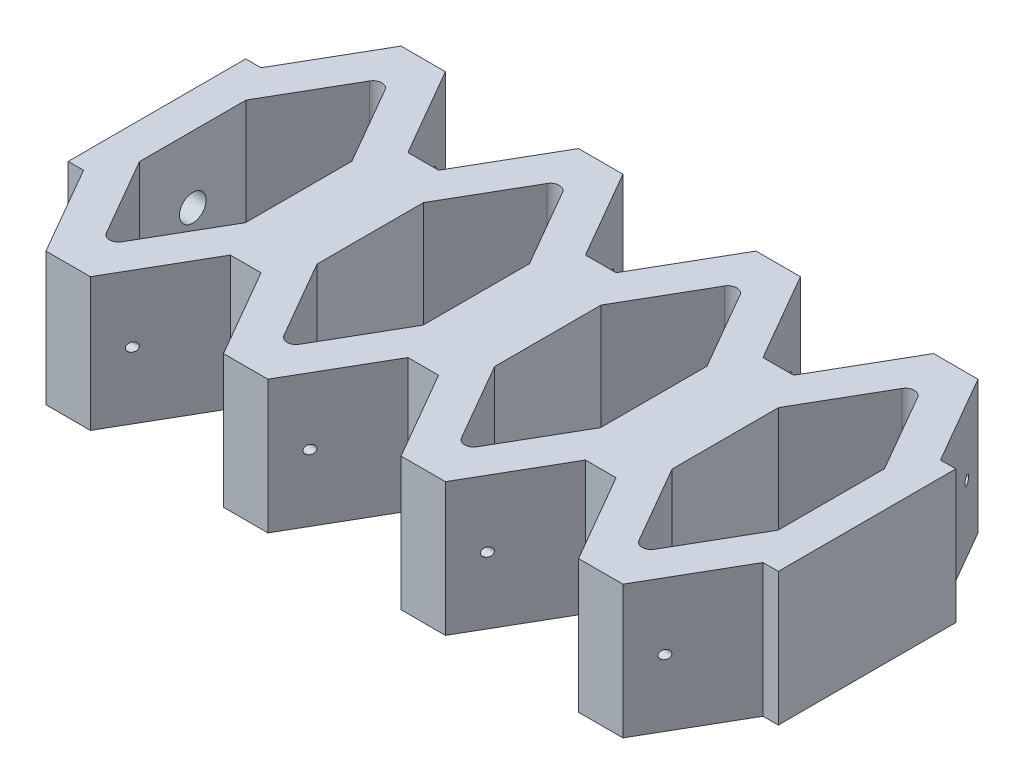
ISO-10303-21;
HEADER;
FILE_DESCRIPTION(('STEP AP214'),'2;1');
FILE_NAME('part.step','',(''),(''),'','','');
FILE_SCHEMA(('AUTOMOTIVE_DESIGN { 1 0 10303 214 1 1 1 1 }'));
ENDSEC;
DATA;
#1=APPLICATION_CONTEXT('core data for automotive mechanical design processes');
#2=APPLICATION_PROTOCOL_DEFINITION('international standard','automotive_design',2000,#1);
#3=PRODUCT_CONTEXT('',#1,'mechanical');
#4=PRODUCT('Part','Part','',(#3));
#5=PRODUCT_RELATED_PRODUCT_CATEGORY('part','',(#4));
#6=PRODUCT_DEFINITION_FORMATION('','',#4);
#7=PRODUCT_DEFINITION_CONTEXT('part definition',#1,'design');
#8=PRODUCT_DEFINITION('design','',#6,#7);
#9=PRODUCT_DEFINITION_SHAPE('','',#8);
#10=(LENGTH_UNIT() NAMED_UNIT(*) SI_UNIT(.MILLI.,.METRE.));
#11=(NAMED_UNIT(*) PLANE_ANGLE_UNIT() SI_UNIT($,.RADIAN.));
#12=(NAMED_UNIT(*) SI_UNIT($,.STERADIAN.) SOLID_ANGLE_UNIT());
#13=UNCERTAINTY_MEASURE_WITH_UNIT(LENGTH_MEASURE(1.E-05),#10,'distance_accuracy_value','');
#14=(GEOMETRIC_REPRESENTATION_CONTEXT(3) GLOBAL_UNCERTAINTY_ASSIGNED_CONTEXT((#13)) GLOBAL_UNIT_ASSIGNED_CONTEXT((#10,
#11,#12)) REPRESENTATION_CONTEXT('',''));
#15=CARTESIAN_POINT('',(0.,0.,0.));
#16=DIRECTION('',(0.,0.,1.));
#17=DIRECTION('',(1.,0.,0.));
#18=AXIS2_PLACEMENT_3D('',#15,#16,#17);
#19=CARTESIAN_POINT('',(0.,15.,0.));
#20=DIRECTION('',(0.,1.,0.));
#21=DIRECTION('',(0.,0.,1.));
#22=AXIS2_PLACEMENT_3D('',#19,#20,#21);
#23=PLANE('',#22);
#24=DIRECTION('',(0.,0.,1.));
#25=VECTOR('',#24,1.);
#26=CARTESIAN_POINT('',(0.,15.,-10.));
#27=LINE('',#26,#25);
#28=CARTESIAN_POINT('',(0.,15.,-10.));
#29=VERTEX_POINT('',#28);
#30=CARTESIAN_POINT('',(0.,15.,10.));
#31=VERTEX_POINT('',#30);
#32=EDGE_CURVE('E896',#29,#31,#27,.T.);
#33=ORIENTED_EDGE('',*,*,#32,.T.);
#34=DIRECTION('',(1.,0.,0.));
#35=VECTOR('',#34,1.);
#36=CARTESIAN_POINT('',(0.,15.,10.));
#37=LINE('',#36,#35);
#38=CARTESIAN_POINT('',(1.72649730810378,15.,10.));
#39=VERTEX_POINT('',#38);
#40=EDGE_CURVE('E899',#31,#39,#37,.T.);
#41=ORIENTED_EDGE('',*,*,#40,.T.);
#42=DIRECTION('',(0.499999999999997,0.,0.86602540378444));
#43=VECTOR('',#42,1.);
#44=CARTESIAN_POINT('',(1.72649730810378,15.,10.));
#45=LINE('',#44,#43);
#46=CARTESIAN_POINT('',(7.5,15.,20.));
#47=VERTEX_POINT('',#46);
#48=EDGE_CURVE('E902',#39,#47,#45,.T.);
#49=ORIENTED_EDGE('',*,*,#48,.T.);
#50=DIRECTION('',(1.,0.,0.));
#51=VECTOR('',#50,1.);
#52=CARTESIAN_POINT('',(7.5,15.,20.));
#53=LINE('',#52,#51);
#54=CARTESIAN_POINT('',(12.5,15.,20.));
#55=VERTEX_POINT('',#54);
#56=EDGE_CURVE('E904',#47,#55,#53,.T.);
#57=ORIENTED_EDGE('',*,*,#56,.T.);
#58=DIRECTION('',(0.499999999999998,0.,-0.86602540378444));
#59=VECTOR('',#58,1.);
#60=CARTESIAN_POINT('',(12.5,15.,20.));
#61=LINE('',#60,#59);
#62=CARTESIAN_POINT('',(18.2735026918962,15.,10.));
#63=VERTEX_POINT('',#62);
#64=EDGE_CURVE('E906',#55,#63,#61,.T.);
#65=ORIENTED_EDGE('',*,*,#64,.T.);
#66=DIRECTION('',(1.,0.,0.));
#67=VECTOR('',#66,1.);
#68=CARTESIAN_POINT('',(20.,15.,10.));
#69=LINE('',#68,#67);
#70=CARTESIAN_POINT('',(21.7264973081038,15.,10.));
#71=VERTEX_POINT('',#70);
#72=EDGE_CURVE('E908',#63,#71,#69,.T.);
#73=ORIENTED_EDGE('',*,*,#72,.T.);
#74=DIRECTION('',(0.499999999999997,0.,0.86602540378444));
#75=VECTOR('',#74,1.);
#76=CARTESIAN_POINT('',(21.7264973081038,15.,10.));
#77=LINE('',#76,#75);
#78=CARTESIAN_POINT('',(27.5,15.,20.));
#79=VERTEX_POINT('',#78);
#80=EDGE_CURVE('E785',#71,#79,#77,.T.);
#81=ORIENTED_EDGE('',*,*,#80,.T.);
#82=DIRECTION('',(1.,0.,0.));
#83=VECTOR('',#82,1.);
#84=CARTESIAN_POINT('',(27.5,15.,20.));
#85=LINE('',#84,#83);
#86=CARTESIAN_POINT('',(32.5,15.,20.));
#87=VERTEX_POINT('',#86);
#88=EDGE_CURVE('E787',#79,#87,#85,.T.);
#89=ORIENTED_EDGE('',*,*,#88,.T.);
#90=DIRECTION('',(0.499999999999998,0.,-0.86602540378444));
#91=VECTOR('',#90,1.);
#92=CARTESIAN_POINT('',(32.5,15.,20.));
#93=LINE('',#92,#91);
#94=CARTESIAN_POINT('',(38.2735026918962,15.,10.));
#95=VERTEX_POINT('',#94);
#96=EDGE_CURVE('E790',#87,#95,#93,.T.);
#97=ORIENTED_EDGE('',*,*,#96,.T.);
#98=DIRECTION('',(1.,0.,0.));
#99=VECTOR('',#98,1.);
#100=CARTESIAN_POINT('',(40.,15.,10.));
#101=LINE('',#100,#99);
#102=CARTESIAN_POINT('',(41.7264973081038,15.,10.));
#103=VERTEX_POINT('',#102);
#104=EDGE_CURVE('E792',#95,#103,#101,.T.);
#105=ORIENTED_EDGE('',*,*,#104,.T.);
#106=DIRECTION('',(0.499999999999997,0.,0.86602540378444));
#107=VECTOR('',#106,1.);
#108=CARTESIAN_POINT('',(41.7264973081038,15.,10.));
#109=LINE('',#108,#107);
#110=CARTESIAN_POINT('',(47.5,15.,20.));
#111=VERTEX_POINT('',#110);
#112=EDGE_CURVE('E668',#103,#111,#109,.T.);
#113=ORIENTED_EDGE('',*,*,#112,.T.);
#114=DIRECTION('',(1.,0.,0.));
#115=VECTOR('',#114,1.);
#116=CARTESIAN_POINT('',(47.5,15.,20.));
#117=LINE('',#116,#115);
#118=CARTESIAN_POINT('',(52.5,15.,20.));
#119=VERTEX_POINT('',#118);
#120=EDGE_CURVE('E670',#111,#119,#117,.T.);
#121=ORIENTED_EDGE('',*,*,#120,.T.);
#122=DIRECTION('',(0.499999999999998,0.,-0.86602540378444));
#123=VECTOR('',#122,1.);
#124=CARTESIAN_POINT('',(52.5,15.,20.));
#125=LINE('',#124,#123);
#126=CARTESIAN_POINT('',(58.2735026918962,15.,10.));
#127=VERTEX_POINT('',#126);
#128=EDGE_CURVE('E673',#119,#127,#125,.T.);
#129=ORIENTED_EDGE('',*,*,#128,.T.);
#130=DIRECTION('',(1.,0.,0.));
#131=VECTOR('',#130,1.);
#132=CARTESIAN_POINT('',(60.,15.,10.));
#133=LINE('',#132,#131);
#134=CARTESIAN_POINT('',(61.7264973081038,15.,10.));
#135=VERTEX_POINT('',#134);
#136=EDGE_CURVE('E675',#127,#135,#133,.T.);
#137=ORIENTED_EDGE('',*,*,#136,.T.);
#138=DIRECTION('',(0.499999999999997,0.,0.86602540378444));
#139=VECTOR('',#138,1.);
#140=CARTESIAN_POINT('',(61.7264973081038,15.,10.));
#141=LINE('',#140,#139);
#142=CARTESIAN_POINT('',(67.5,15.,20.));
#143=VERTEX_POINT('',#142);
#144=EDGE_CURVE('E541',#135,#143,#141,.T.);
#145=ORIENTED_EDGE('',*,*,#144,.T.);
#146=DIRECTION('',(1.,0.,0.));
#147=VECTOR('',#146,1.);
#148=CARTESIAN_POINT('',(67.5,15.,20.));
#149=LINE('',#148,#147);
#150=CARTESIAN_POINT('',(72.5,15.,20.));
#151=VERTEX_POINT('',#150);
#152=EDGE_CURVE('E543',#143,#151,#149,.T.);
#153=ORIENTED_EDGE('',*,*,#152,.T.);
#154=DIRECTION('',(0.499999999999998,0.,-0.86602540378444));
#155=VECTOR('',#154,1.);
#156=CARTESIAN_POINT('',(72.5,15.,20.));
#157=LINE('',#156,#155);
#158=CARTESIAN_POINT('',(78.2735026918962,15.,10.));
#159=VERTEX_POINT('',#158);
#160=EDGE_CURVE('E546',#151,#159,#157,.T.);
#161=ORIENTED_EDGE('',*,*,#160,.T.);
#162=DIRECTION('',(1.,0.,0.));
#163=VECTOR('',#162,1.);
#164=CARTESIAN_POINT('',(80.,15.,10.));
#165=LINE('',#164,#163);
#166=CARTESIAN_POINT('',(80.,15.,10.));
#167=VERTEX_POINT('',#166);
#168=EDGE_CURVE('E548',#159,#167,#165,.T.);
#169=ORIENTED_EDGE('',*,*,#168,.T.);
#170=DIRECTION('',(0.,0.,-1.));
#171=VECTOR('',#170,1.);
#172=CARTESIAN_POINT('',(80.,15.,-10.));
#173=LINE('',#172,#171);
#174=CARTESIAN_POINT('',(80.,15.,-10.));
#175=VERTEX_POINT('',#174);
#176=EDGE_CURVE('E550',#167,#175,#173,.T.);
#177=ORIENTED_EDGE('',*,*,#176,.T.);
#178=DIRECTION('',(-1.,0.,0.));
#179=VECTOR('',#178,1.);
#180=CARTESIAN_POINT('',(78.2735026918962,15.,-10.));
#181=LINE('',#180,#179);
#182=CARTESIAN_POINT('',(78.2735026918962,15.,-10.));
#183=VERTEX_POINT('',#182);
#184=EDGE_CURVE('E552',#175,#183,#181,.T.);
#185=ORIENTED_EDGE('',*,*,#184,.T.);
#186=DIRECTION('',(-0.499999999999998,0.,-0.86602540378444));
#187=VECTOR('',#186,1.);
#188=CARTESIAN_POINT('',(72.5,15.,-20.));
#189=LINE('',#188,#187);
#190=CARTESIAN_POINT('',(72.5,15.,-20.));
#191=VERTEX_POINT('',#190);
#192=EDGE_CURVE('E554',#183,#191,#189,.T.);
#193=ORIENTED_EDGE('',*,*,#192,.T.);
#194=DIRECTION('',(-1.,0.,0.));
#195=VECTOR('',#194,1.);
#196=CARTESIAN_POINT('',(67.5,15.,-20.));
#197=LINE('',#196,#195);
#198=CARTESIAN_POINT('',(67.5,15.,-20.));
#199=VERTEX_POINT('',#198);
#200=EDGE_CURVE('E556',#191,#199,#197,.T.);
#201=ORIENTED_EDGE('',*,*,#200,.T.);
#202=DIRECTION('',(-0.499999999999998,0.,0.86602540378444));
#203=VECTOR('',#202,1.);
#204=CARTESIAN_POINT('',(61.7264973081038,15.,-10.));
#205=LINE('',#204,#203);
#206=CARTESIAN_POINT('',(61.7264973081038,15.,-10.));
#207=VERTEX_POINT('',#206);
#208=EDGE_CURVE('E558',#199,#207,#205,.T.);
#209=ORIENTED_EDGE('',*,*,#208,.T.);
#210=DIRECTION('',(-1.,0.,0.));
#211=VECTOR('',#210,1.);
#212=CARTESIAN_POINT('',(58.2735026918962,15.,-10.));
#213=LINE('',#212,#211);
#214=CARTESIAN_POINT('',(58.2735026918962,15.,-10.));
#215=VERTEX_POINT('',#214);
#216=EDGE_CURVE('E677',#207,#215,#213,.T.);
#217=ORIENTED_EDGE('',*,*,#216,.T.);
#218=DIRECTION('',(-0.499999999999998,0.,-0.86602540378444));
#219=VECTOR('',#218,1.);
#220=CARTESIAN_POINT('',(52.5,15.,-20.));
#221=LINE('',#220,#219);
#222=CARTESIAN_POINT('',(52.5,15.,-20.));
#223=VERTEX_POINT('',#222);
#224=EDGE_CURVE('E679',#215,#223,#221,.T.);
#225=ORIENTED_EDGE('',*,*,#224,.T.);
#226=DIRECTION('',(-1.,0.,0.));
#227=VECTOR('',#226,1.);
#228=CARTESIAN_POINT('',(47.5,15.,-20.));
#229=LINE('',#228,#227);
#230=CARTESIAN_POINT('',(47.5,15.,-20.));
#231=VERTEX_POINT('',#230);
#232=EDGE_CURVE('E681',#223,#231,#229,.T.);
#233=ORIENTED_EDGE('',*,*,#232,.T.);
#234=DIRECTION('',(-0.499999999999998,0.,0.86602540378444));
#235=VECTOR('',#234,1.);
#236=CARTESIAN_POINT('',(41.7264973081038,15.,-10.));
#237=LINE('',#236,#235);
#238=CARTESIAN_POINT('',(41.7264973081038,15.,-10.));
#239=VERTEX_POINT('',#238);
#240=EDGE_CURVE('E683',#231,#239,#237,.T.);
#241=ORIENTED_EDGE('',*,*,#240,.T.);
#242=DIRECTION('',(-1.,0.,0.));
#243=VECTOR('',#242,1.);
#244=CARTESIAN_POINT('',(38.2735026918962,15.,-10.));
#245=LINE('',#244,#243);
#246=CARTESIAN_POINT('',(38.2735026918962,15.,-10.));
#247=VERTEX_POINT('',#246);
#248=EDGE_CURVE('E794',#239,#247,#245,.T.);
#249=ORIENTED_EDGE('',*,*,#248,.T.);
#250=DIRECTION('',(-0.499999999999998,0.,-0.86602540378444));
#251=VECTOR('',#250,1.);
#252=CARTESIAN_POINT('',(32.5,15.,-20.));
#253=LINE('',#252,#251);
#254=CARTESIAN_POINT('',(32.5,15.,-20.));
#255=VERTEX_POINT('',#254);
#256=EDGE_CURVE('E796',#247,#255,#253,.T.);
#257=ORIENTED_EDGE('',*,*,#256,.T.);
#258=DIRECTION('',(-1.,0.,0.));
#259=VECTOR('',#258,1.);
#260=CARTESIAN_POINT('',(27.5,15.,-20.));
#261=LINE('',#260,#259);
#262=CARTESIAN_POINT('',(27.5,15.,-20.));
#263=VERTEX_POINT('',#262);
#264=EDGE_CURVE('E798',#255,#263,#261,.T.);
#265=ORIENTED_EDGE('',*,*,#264,.T.);
#266=DIRECTION('',(-0.499999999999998,0.,0.86602540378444));
#267=VECTOR('',#266,1.);
#268=CARTESIAN_POINT('',(21.7264973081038,15.,-10.));
#269=LINE('',#268,#267);
#270=CARTESIAN_POINT('',(21.7264973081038,15.,-10.));
#271=VERTEX_POINT('',#270);
#272=EDGE_CURVE('E800',#263,#271,#269,.T.);
#273=ORIENTED_EDGE('',*,*,#272,.T.);
#274=DIRECTION('',(-1.,0.,0.));
#275=VECTOR('',#274,1.);
#276=CARTESIAN_POINT('',(18.2735026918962,15.,-10.));
#277=LINE('',#276,#275);
#278=CARTESIAN_POINT('',(18.2735026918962,15.,-10.));
#279=VERTEX_POINT('',#278);
#280=EDGE_CURVE('E910',#271,#279,#277,.T.);
#281=ORIENTED_EDGE('',*,*,#280,.T.);
#282=DIRECTION('',(-0.499999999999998,0.,-0.86602540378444));
#283=VECTOR('',#282,1.);
#284=CARTESIAN_POINT('',(12.5,15.,-20.));
#285=LINE('',#284,#283);
#286=CARTESIAN_POINT('',(12.5,15.,-20.));
#287=VERTEX_POINT('',#286);
#288=EDGE_CURVE('E912',#279,#287,#285,.T.);
#289=ORIENTED_EDGE('',*,*,#288,.T.);
#290=DIRECTION('',(-1.,0.,0.));
#291=VECTOR('',#290,1.);
#292=CARTESIAN_POINT('',(7.5,15.,-20.));
#293=LINE('',#292,#291);
#294=CARTESIAN_POINT('',(7.5,15.,-20.));
#295=VERTEX_POINT('',#294);
#296=EDGE_CURVE('E914',#287,#295,#293,.T.);
#297=ORIENTED_EDGE('',*,*,#296,.T.);
#298=DIRECTION('',(-0.499999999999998,0.,0.86602540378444));
#299=VECTOR('',#298,1.);
#300=CARTESIAN_POINT('',(1.72649730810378,15.,-10.));
#301=LINE('',#300,#299);
#302=CARTESIAN_POINT('',(1.72649730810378,15.,-10.));
#303=VERTEX_POINT('',#302);
#304=EDGE_CURVE('E916',#295,#303,#301,.T.);
#305=ORIENTED_EDGE('',*,*,#304,.T.);
#306=DIRECTION('',(-1.,0.,0.));
#307=VECTOR('',#306,1.);
#308=CARTESIAN_POINT('',(0.,15.,-10.));
#309=LINE('',#308,#307);
#310=EDGE_CURVE('E918',#303,#29,#309,.T.);
#311=ORIENTED_EDGE('',*,*,#310,.T.);
#312=EDGE_LOOP('',(#33,#41,#49,#57,#65,#73,#81,#89,#97,#105,#113,#121,#129,#137,#145,#153,#161,
#169,#177,#185,#193,#201,#209,#217,#225,#233,#241,#249,#257,#265,#273,#281,#289,#297,#305,#311));
#313=FACE_BOUND('',#312,.T.);
#314=DIRECTION('',(0.499999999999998,0.,0.86602540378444));
#315=VECTOR('',#314,1.);
#316=CARTESIAN_POINT('',(4.0358983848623,15.,6.00000000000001));
#317=LINE('',#316,#315);
#318=CARTESIAN_POINT('',(4.0358983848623,15.,6.00000000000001));
#319=VERTEX_POINT('',#318);
#320=CARTESIAN_POINT('',(9.13397459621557,15.,14.8301270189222));
#321=VERTEX_POINT('',#320);
#322=EDGE_CURVE('E844',#319,#321,#317,.T.);
#323=ORIENTED_EDGE('',*,*,#322,.F.);
#324=DIRECTION('',(0.,0.,1.));
#325=VECTOR('',#324,1.);
#326=CARTESIAN_POINT('',(4.03589838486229,15.,-6.00000000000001));
#327=LINE('',#326,#325);
#328=CARTESIAN_POINT('',(4.03589838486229,15.,-6.00000000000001));
#329=VERTEX_POINT('',#328);
#330=EDGE_CURVE('E842',#329,#319,#327,.T.);
#331=ORIENTED_EDGE('',*,*,#330,.F.);
#332=DIRECTION('',(-0.499999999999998,0.,0.86602540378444));
#333=VECTOR('',#332,1.);
#334=CARTESIAN_POINT('',(4.03589838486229,15.,-6.00000000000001));
#335=LINE('',#334,#333);
#336=CARTESIAN_POINT('',(9.13397459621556,15.,-14.8301270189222));
#337=VERTEX_POINT('',#336);
#338=EDGE_CURVE('E857',#337,#329,#335,.T.);
#339=ORIENTED_EDGE('',*,*,#338,.F.);
#340=CARTESIAN_POINT('',(10.,15.,-14.3301270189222));
#341=DIRECTION('',(0.,1.,0.));
#342=DIRECTION('',(0.,0.,1.));
#343=AXIS2_PLACEMENT_3D('',#340,#341,#342);
#344=CIRCLE('',#343,1.);
#345=CARTESIAN_POINT('',(10.8660254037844,15.,-14.8301270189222));
#346=VERTEX_POINT('',#345);
#347=EDGE_CURVE('E855',#346,#337,#344,.T.);
#348=ORIENTED_EDGE('',*,*,#347,.F.);
#349=DIRECTION('',(-0.499999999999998,0.,-0.86602540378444));
#350=VECTOR('',#349,1.);
#351=CARTESIAN_POINT('',(10.8660254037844,15.,-14.8301270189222));
#352=LINE('',#351,#350);
#353=CARTESIAN_POINT('',(15.9641016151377,15.,-6.00000000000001));
#354=VERTEX_POINT('',#353);
#355=EDGE_CURVE('E853',#354,#346,#352,.T.);
#356=ORIENTED_EDGE('',*,*,#355,.F.);
#357=DIRECTION('',(0.,0.,-1.));
#358=VECTOR('',#357,1.);
#359=CARTESIAN_POINT('',(15.9641016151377,15.,-6.00000000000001));
#360=LINE('',#359,#358);
#361=CARTESIAN_POINT('',(15.9641016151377,15.,6.00000000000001));
#362=VERTEX_POINT('',#361);
#363=EDGE_CURVE('E851',#362,#354,#360,.T.);
#364=ORIENTED_EDGE('',*,*,#363,.F.);
#365=DIRECTION('',(0.499999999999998,0.,-0.86602540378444));
#366=VECTOR('',#365,1.);
#367=CARTESIAN_POINT('',(10.8660254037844,15.,14.8301270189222));
#368=LINE('',#367,#366);
#369=CARTESIAN_POINT('',(10.8660254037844,15.,14.8301270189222));
#370=VERTEX_POINT('',#369);
#371=EDGE_CURVE('E849',#370,#362,#368,.T.);
#372=ORIENTED_EDGE('',*,*,#371,.F.);
#373=CARTESIAN_POINT('',(10.,15.,14.3301270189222));
#374=DIRECTION('',(0.,1.,0.));
#375=DIRECTION('',(0.,0.,-1.));
#376=AXIS2_PLACEMENT_3D('',#373,#374,#375);
#377=CIRCLE('',#376,0.999999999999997);
#378=EDGE_CURVE('E847',#321,#370,#377,.T.);
#379=ORIENTED_EDGE('',*,*,#378,.F.);
#380=EDGE_LOOP('',(#323,#331,#339,#348,#356,#364,#372,#379));
#381=FACE_BOUND('',#380,.T.);
#382=DIRECTION('',(0.499999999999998,0.,0.86602540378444));
#383=VECTOR('',#382,1.);
#384=CARTESIAN_POINT('',(24.0358983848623,15.,6.00000000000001));
#385=LINE('',#384,#383);
#386=CARTESIAN_POINT('',(24.0358983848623,15.,6.00000000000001));
#387=VERTEX_POINT('',#386);
#388=CARTESIAN_POINT('',(29.1339745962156,15.,14.8301270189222));
#389=VERTEX_POINT('',#388);
#390=EDGE_CURVE('E728',#387,#389,#385,.T.);
#391=ORIENTED_EDGE('',*,*,#390,.F.);
#392=DIRECTION('',(0.,0.,1.));
#393=VECTOR('',#392,1.);
#394=CARTESIAN_POINT('',(24.0358983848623,15.,-6.00000000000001));
#395=LINE('',#394,#393);
#396=CARTESIAN_POINT('',(24.0358983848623,15.,-6.00000000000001));
#397=VERTEX_POINT('',#396);
#398=EDGE_CURVE('E726',#397,#387,#395,.T.);
#399=ORIENTED_EDGE('',*,*,#398,.F.);
#400=DIRECTION('',(-0.499999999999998,0.,0.86602540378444));
#401=VECTOR('',#400,1.);
#402=CARTESIAN_POINT('',(24.0358983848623,15.,-6.00000000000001));
#403=LINE('',#402,#401);
#404=CARTESIAN_POINT('',(29.1339745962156,15.,-14.8301270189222));
#405=VERTEX_POINT('',#404);
#406=EDGE_CURVE('E742',#405,#397,#403,.T.);
#407=ORIENTED_EDGE('',*,*,#406,.F.);
#408=CARTESIAN_POINT('',(30.,15.,-14.3301270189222));
#409=DIRECTION('',(0.,1.,0.));
#410=DIRECTION('',(0.,0.,1.));
#411=AXIS2_PLACEMENT_3D('',#408,#409,#410);
#412=CIRCLE('',#411,1.);
#413=CARTESIAN_POINT('',(30.8660254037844,15.,-14.8301270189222));
#414=VERTEX_POINT('',#413);
#415=EDGE_CURVE('E739',#414,#405,#412,.T.);
#416=ORIENTED_EDGE('',*,*,#415,.F.);
#417=DIRECTION('',(-0.499999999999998,0.,-0.86602540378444));
#418=VECTOR('',#417,1.);
#419=CARTESIAN_POINT('',(30.8660254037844,15.,-14.8301270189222));
#420=LINE('',#419,#418);
#421=CARTESIAN_POINT('',(35.9641016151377,15.,-6.00000000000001));
#422=VERTEX_POINT('',#421);
#423=EDGE_CURVE('E737',#422,#414,#420,.T.);
#424=ORIENTED_EDGE('',*,*,#423,.F.);
#425=DIRECTION('',(0.,0.,-1.));
#426=VECTOR('',#425,1.);
#427=CARTESIAN_POINT('',(35.9641016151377,15.,-6.00000000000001));
#428=LINE('',#427,#426);
#429=CARTESIAN_POINT('',(35.9641016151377,15.,6.00000000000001));
#430=VERTEX_POINT('',#429);
#431=EDGE_CURVE('E735',#430,#422,#428,.T.);
#432=ORIENTED_EDGE('',*,*,#431,.F.);
#433=DIRECTION('',(0.499999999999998,0.,-0.86602540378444));
#434=VECTOR('',#433,1.);
#435=CARTESIAN_POINT('',(30.8660254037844,15.,14.8301270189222));
#436=LINE('',#435,#434);
#437=CARTESIAN_POINT('',(30.8660254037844,15.,14.8301270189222));
#438=VERTEX_POINT('',#437);
#439=EDGE_CURVE('E733',#438,#430,#436,.T.);
#440=ORIENTED_EDGE('',*,*,#439,.F.);
#441=CARTESIAN_POINT('',(30.,15.,14.3301270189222));
#442=DIRECTION('',(0.,1.,0.));
#443=DIRECTION('',(0.,0.,-1.));
#444=AXIS2_PLACEMENT_3D('',#441,#442,#443);
#445=CIRCLE('',#444,0.999999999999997);
#446=EDGE_CURVE('E731',#389,#438,#445,.T.);
#447=ORIENTED_EDGE('',*,*,#446,.F.);
#448=EDGE_LOOP('',(#391,#399,#407,#416,#424,#432,#440,#447));
#449=FACE_BOUND('',#448,.T.);
#450=DIRECTION('',(0.499999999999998,0.,0.86602540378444));
#451=VECTOR('',#450,1.);
#452=CARTESIAN_POINT('',(44.0358983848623,15.,6.00000000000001));
#453=LINE('',#452,#451);
#454=CARTESIAN_POINT('',(44.0358983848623,15.,6.00000000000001));
#455=VERTEX_POINT('',#454);
#456=CARTESIAN_POINT('',(49.1339745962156,15.,14.8301270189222));
#457=VERTEX_POINT('',#456);
#458=EDGE_CURVE('E611',#455,#457,#453,.T.);
#459=ORIENTED_EDGE('',*,*,#458,.F.);
#460=DIRECTION('',(0.,0.,1.));
#461=VECTOR('',#460,1.);
#462=CARTESIAN_POINT('',(44.0358983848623,15.,-6.00000000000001));
#463=LINE('',#462,#461);
#464=CARTESIAN_POINT('',(44.0358983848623,15.,-6.00000000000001));
#465=VERTEX_POINT('',#464);
#466=EDGE_CURVE('E609',#465,#455,#463,.T.);
#467=ORIENTED_EDGE('',*,*,#466,.F.);
#468=DIRECTION('',(-0.499999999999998,0.,0.86602540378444));
#469=VECTOR('',#468,1.);
#470=CARTESIAN_POINT('',(44.0358983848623,15.,-6.00000000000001));
#471=LINE('',#470,#469);
#472=CARTESIAN_POINT('',(49.1339745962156,15.,-14.8301270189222));
#473=VERTEX_POINT('',#472);
#474=EDGE_CURVE('E625',#473,#465,#471,.T.);
#475=ORIENTED_EDGE('',*,*,#474,.F.);
#476=CARTESIAN_POINT('',(50.,15.,-14.3301270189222));
#477=DIRECTION('',(0.,1.,0.));
#478=DIRECTION('',(0.,0.,1.));
#479=AXIS2_PLACEMENT_3D('',#476,#477,#478);
#480=CIRCLE('',#479,1.);
#481=CARTESIAN_POINT('',(50.8660254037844,15.,-14.8301270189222));
#482=VERTEX_POINT('',#481);
#483=EDGE_CURVE('E622',#482,#473,#480,.T.);
#484=ORIENTED_EDGE('',*,*,#483,.F.);
#485=DIRECTION('',(-0.499999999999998,0.,-0.86602540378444));
#486=VECTOR('',#485,1.);
#487=CARTESIAN_POINT('',(50.8660254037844,15.,-14.8301270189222));
#488=LINE('',#487,#486);
#489=CARTESIAN_POINT('',(55.9641016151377,15.,-6.00000000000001));
#490=VERTEX_POINT('',#489);
#491=EDGE_CURVE('E620',#490,#482,#488,.T.);
#492=ORIENTED_EDGE('',*,*,#491,.F.);
#493=DIRECTION('',(0.,0.,-1.));
#494=VECTOR('',#493,1.);
#495=CARTESIAN_POINT('',(55.9641016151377,15.,-6.00000000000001));
#496=LINE('',#495,#494);
#497=CARTESIAN_POINT('',(55.9641016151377,15.,6.00000000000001));
#498=VERTEX_POINT('',#497);
#499=EDGE_CURVE('E618',#498,#490,#496,.T.);
#500=ORIENTED_EDGE('',*,*,#499,.F.);
#501=DIRECTION('',(0.499999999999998,0.,-0.86602540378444));
#502=VECTOR('',#501,1.);
#503=CARTESIAN_POINT('',(50.8660254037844,15.,14.8301270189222));
#504=LINE('',#503,#502);
#505=CARTESIAN_POINT('',(50.8660254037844,15.,14.8301270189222));
#506=VERTEX_POINT('',#505);
#507=EDGE_CURVE('E616',#506,#498,#504,.T.);
#508=ORIENTED_EDGE('',*,*,#507,.F.);
#509=CARTESIAN_POINT('',(50.,15.,14.3301270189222));
#510=DIRECTION('',(0.,1.,0.));
#511=DIRECTION('',(0.,0.,-1.));
#512=AXIS2_PLACEMENT_3D('',#509,#510,#511);
#513=CIRCLE('',#512,0.999999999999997);
#514=EDGE_CURVE('E614',#457,#506,#513,.T.);
#515=ORIENTED_EDGE('',*,*,#514,.F.);
#516=EDGE_LOOP('',(#459,#467,#475,#484,#492,#500,#508,#515));
#517=FACE_BOUND('',#516,.T.);
#518=DIRECTION('',(0.499999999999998,0.,0.86602540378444));
#519=VECTOR('',#518,1.);
#520=CARTESIAN_POINT('',(64.0358983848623,15.,6.00000000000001));
#521=LINE('',#520,#519);
#522=CARTESIAN_POINT('',(64.0358983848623,15.,6.00000000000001));
#523=VERTEX_POINT('',#522);
#524=CARTESIAN_POINT('',(69.1339745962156,15.,14.8301270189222));
#525=VERTEX_POINT('',#524);
#526=EDGE_CURVE('E479',#523,#525,#521,.T.);
#527=ORIENTED_EDGE('',*,*,#526,.F.);
#528=DIRECTION('',(0.,0.,1.));
#529=VECTOR('',#528,1.);
#530=CARTESIAN_POINT('',(64.0358983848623,15.,-6.00000000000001));
#531=LINE('',#530,#529);
#532=CARTESIAN_POINT('',(64.0358983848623,15.,-6.00000000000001));
#533=VERTEX_POINT('',#532);
#534=EDGE_CURVE('E469',#533,#523,#531,.T.);
#535=ORIENTED_EDGE('',*,*,#534,.F.);
#536=DIRECTION('',(-0.499999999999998,0.,0.86602540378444));
#537=VECTOR('',#536,1.);
#538=CARTESIAN_POINT('',(64.0358983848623,15.,-6.00000000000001));
#539=LINE('',#538,#537);
#540=CARTESIAN_POINT('',(69.1339745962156,15.,-14.8301270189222));
#541=VERTEX_POINT('',#540);
#542=EDGE_CURVE('E506',#541,#533,#539,.T.);
#543=ORIENTED_EDGE('',*,*,#542,.F.);
#544=CARTESIAN_POINT('',(70.,15.,-14.3301270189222));
#545=DIRECTION('',(0.,1.,0.));
#546=DIRECTION('',(0.,0.,1.));
#547=AXIS2_PLACEMENT_3D('',#544,#545,#546);
#548=CIRCLE('',#547,1.);
#549=CARTESIAN_POINT('',(70.8660254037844,15.,-14.8301270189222));
#550=VERTEX_POINT('',#549);
#551=EDGE_CURVE('E503',#550,#541,#548,.T.);
#552=ORIENTED_EDGE('',*,*,#551,.F.);
#553=DIRECTION('',(-0.499999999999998,0.,-0.86602540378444));
#554=VECTOR('',#553,1.);
#555=CARTESIAN_POINT('',(70.8660254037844,15.,-14.8301270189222));
#556=LINE('',#555,#554);
#557=CARTESIAN_POINT('',(75.9641016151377,15.,-6.00000000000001));
#558=VERTEX_POINT('',#557);
#559=EDGE_CURVE('E501',#558,#550,#556,.T.);
#560=ORIENTED_EDGE('',*,*,#559,.F.);
#561=DIRECTION('',(0.,0.,-1.));
#562=VECTOR('',#561,1.);
#563=CARTESIAN_POINT('',(75.9641016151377,15.,-6.00000000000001));
#564=LINE('',#563,#562);
#565=CARTESIAN_POINT('',(75.9641016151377,15.,6.00000000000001));
#566=VERTEX_POINT('',#565);
#567=EDGE_CURVE('E499',#566,#558,#564,.T.);
#568=ORIENTED_EDGE('',*,*,#567,.F.);
#569=DIRECTION('',(0.499999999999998,0.,-0.86602540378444));
#570=VECTOR('',#569,1.);
#571=CARTESIAN_POINT('',(70.8660254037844,15.,14.8301270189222));
#572=LINE('',#571,#570);
#573=CARTESIAN_POINT('',(70.8660254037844,15.,14.8301270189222));
#574=VERTEX_POINT('',#573);
#575=EDGE_CURVE('E494',#574,#566,#572,.T.);
#576=ORIENTED_EDGE('',*,*,#575,.F.);
#577=CARTESIAN_POINT('',(70.,15.,14.3301270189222));
#578=DIRECTION('',(0.,1.,0.));
#579=DIRECTION('',(0.,0.,-1.));
#580=AXIS2_PLACEMENT_3D('',#577,#578,#579);
#581=CIRCLE('',#580,0.999999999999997);
#582=EDGE_CURVE('E492',#525,#574,#581,.T.);
#583=ORIENTED_EDGE('',*,*,#582,.F.);
#584=EDGE_LOOP('',(#527,#535,#543,#552,#560,#568,#576,#583));
#585=FACE_BOUND('',#584,.T.);
#586=ADVANCED_FACE('F39',(#313,#381,#449,#517,#585),#23,.T.);
#587=CARTESIAN_POINT('',(0.,0.,0.));
#588=DIRECTION('',(0.,1.,0.));
#589=DIRECTION('',(0.,0.,1.));
#590=AXIS2_PLACEMENT_3D('',#587,#588,#589);
#591=PLANE('',#590);
#592=DIRECTION('',(0.,0.,1.));
#593=VECTOR('',#592,1.);
#594=CARTESIAN_POINT('',(0.,0.,-10.));
#595=LINE('',#594,#593);
#596=CARTESIAN_POINT('',(0.,0.,-10.));
#597=VERTEX_POINT('',#596);
#598=CARTESIAN_POINT('',(0.,0.,10.));
#599=VERTEX_POINT('',#598);
#600=EDGE_CURVE('E895',#597,#599,#595,.T.);
#601=ORIENTED_EDGE('',*,*,#600,.F.);
#602=DIRECTION('',(-1.,0.,0.));
#603=VECTOR('',#602,1.);
#604=CARTESIAN_POINT('',(0.,0.,-10.));
#605=LINE('',#604,#603);
#606=CARTESIAN_POINT('',(1.72649730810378,0.,-10.));
#607=VERTEX_POINT('',#606);
#608=EDGE_CURVE('E900',#607,#597,#605,.T.);
#609=ORIENTED_EDGE('',*,*,#608,.F.);
#610=DIRECTION('',(-0.499999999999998,0.,0.86602540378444));
#611=VECTOR('',#610,1.);
#612=CARTESIAN_POINT('',(1.72649730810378,0.,-10.));
#613=LINE('',#612,#611);
#614=CARTESIAN_POINT('',(7.5,0.,-20.));
#615=VERTEX_POINT('',#614);
#616=EDGE_CURVE('E939',#615,#607,#613,.T.);
#617=ORIENTED_EDGE('',*,*,#616,.F.);
#618=DIRECTION('',(-1.,0.,0.));
#619=VECTOR('',#618,1.);
#620=CARTESIAN_POINT('',(7.5,0.,-20.));
#621=LINE('',#620,#619);
#622=CARTESIAN_POINT('',(12.5,0.,-20.));
#623=VERTEX_POINT('',#622);
#624=EDGE_CURVE('E937',#623,#615,#621,.T.);
#625=ORIENTED_EDGE('',*,*,#624,.F.);
#626=DIRECTION('',(-0.499999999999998,0.,-0.86602540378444));
#627=VECTOR('',#626,1.);
#628=CARTESIAN_POINT('',(12.5,0.,-20.));
#629=LINE('',#628,#627);
#630=CARTESIAN_POINT('',(18.2735026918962,0.,-10.));
#631=VERTEX_POINT('',#630);
#632=EDGE_CURVE('E935',#631,#623,#629,.T.);
#633=ORIENTED_EDGE('',*,*,#632,.F.);
#634=DIRECTION('',(-1.,0.,0.));
#635=VECTOR('',#634,1.);
#636=CARTESIAN_POINT('',(18.2735026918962,0.,-10.));
#637=LINE('',#636,#635);
#638=CARTESIAN_POINT('',(21.7264973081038,0.,-10.));
#639=VERTEX_POINT('',#638);
#640=EDGE_CURVE('E933',#639,#631,#637,.T.);
#641=ORIENTED_EDGE('',*,*,#640,.F.);
#642=DIRECTION('',(-0.499999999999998,0.,0.86602540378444));
#643=VECTOR('',#642,1.);
#644=CARTESIAN_POINT('',(21.7264973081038,0.,-10.));
#645=LINE('',#644,#643);
#646=CARTESIAN_POINT('',(27.5,0.,-20.));
#647=VERTEX_POINT('',#646);
#648=EDGE_CURVE('E788',#647,#639,#645,.T.);
#649=ORIENTED_EDGE('',*,*,#648,.F.);
#650=DIRECTION('',(-1.,0.,0.));
#651=VECTOR('',#650,1.);
#652=CARTESIAN_POINT('',(27.5,0.,-20.));
#653=LINE('',#652,#651);
#654=CARTESIAN_POINT('',(32.5,0.,-20.));
#655=VERTEX_POINT('',#654);
#656=EDGE_CURVE('E815',#655,#647,#653,.T.);
#657=ORIENTED_EDGE('',*,*,#656,.F.);
#658=DIRECTION('',(-0.499999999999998,0.,-0.86602540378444));
#659=VECTOR('',#658,1.);
#660=CARTESIAN_POINT('',(32.5,0.,-20.));
#661=LINE('',#660,#659);
#662=CARTESIAN_POINT('',(38.2735026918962,0.,-10.));
#663=VERTEX_POINT('',#662);
#664=EDGE_CURVE('E813',#663,#655,#661,.T.);
#665=ORIENTED_EDGE('',*,*,#664,.F.);
#666=DIRECTION('',(-1.,0.,0.));
#667=VECTOR('',#666,1.);
#668=CARTESIAN_POINT('',(38.2735026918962,0.,-10.));
#669=LINE('',#668,#667);
#670=CARTESIAN_POINT('',(41.7264973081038,0.,-10.));
#671=VERTEX_POINT('',#670);
#672=EDGE_CURVE('E811',#671,#663,#669,.T.);
#673=ORIENTED_EDGE('',*,*,#672,.F.);
#674=DIRECTION('',(-0.499999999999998,0.,0.86602540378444));
#675=VECTOR('',#674,1.);
#676=CARTESIAN_POINT('',(41.7264973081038,0.,-10.));
#677=LINE('',#676,#675);
#678=CARTESIAN_POINT('',(47.5,0.,-20.));
#679=VERTEX_POINT('',#678);
#680=EDGE_CURVE('E671',#679,#671,#677,.T.);
#681=ORIENTED_EDGE('',*,*,#680,.F.);
#682=DIRECTION('',(-1.,0.,0.));
#683=VECTOR('',#682,1.);
#684=CARTESIAN_POINT('',(47.5,0.,-20.));
#685=LINE('',#684,#683);
#686=CARTESIAN_POINT('',(52.5,0.,-20.));
#687=VERTEX_POINT('',#686);
#688=EDGE_CURVE('E698',#687,#679,#685,.T.);
#689=ORIENTED_EDGE('',*,*,#688,.F.);
#690=DIRECTION('',(-0.499999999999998,0.,-0.86602540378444));
#691=VECTOR('',#690,1.);
#692=CARTESIAN_POINT('',(52.5,0.,-20.));
#693=LINE('',#692,#691);
#694=CARTESIAN_POINT('',(58.2735026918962,0.,-10.));
#695=VERTEX_POINT('',#694);
#696=EDGE_CURVE('E696',#695,#687,#693,.T.);
#697=ORIENTED_EDGE('',*,*,#696,.F.);
#698=DIRECTION('',(-1.,0.,0.));
#699=VECTOR('',#698,1.);
#700=CARTESIAN_POINT('',(58.2735026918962,0.,-10.));
#701=LINE('',#700,#699);
#702=CARTESIAN_POINT('',(61.7264973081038,0.,-10.));
#703=VERTEX_POINT('',#702);
#704=EDGE_CURVE('E694',#703,#695,#701,.T.);
#705=ORIENTED_EDGE('',*,*,#704,.F.);
#706=DIRECTION('',(-0.499999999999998,0.,0.86602540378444));
#707=VECTOR('',#706,1.);
#708=CARTESIAN_POINT('',(61.7264973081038,0.,-10.));
#709=LINE('',#708,#707);
#710=CARTESIAN_POINT('',(67.5,0.,-20.));
#711=VERTEX_POINT('',#710);
#712=EDGE_CURVE('E544',#711,#703,#709,.T.);
#713=ORIENTED_EDGE('',*,*,#712,.F.);
#714=DIRECTION('',(-1.,0.,0.));
#715=VECTOR('',#714,1.);
#716=CARTESIAN_POINT('',(67.5,0.,-20.));
#717=LINE('',#716,#715);
#718=CARTESIAN_POINT('',(72.5,0.,-20.));
#719=VERTEX_POINT('',#718);
#720=EDGE_CURVE('E575',#719,#711,#717,.T.);
#721=ORIENTED_EDGE('',*,*,#720,.F.);
#722=DIRECTION('',(-0.499999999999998,0.,-0.86602540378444));
#723=VECTOR('',#722,1.);
#724=CARTESIAN_POINT('',(72.5,0.,-20.));
#725=LINE('',#724,#723);
#726=CARTESIAN_POINT('',(78.2735026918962,0.,-10.));
#727=VERTEX_POINT('',#726);
#728=EDGE_CURVE('E573',#727,#719,#725,.T.);
#729=ORIENTED_EDGE('',*,*,#728,.F.);
#730=DIRECTION('',(-1.,0.,0.));
#731=VECTOR('',#730,1.);
#732=CARTESIAN_POINT('',(78.2735026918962,0.,-10.));
#733=LINE('',#732,#731);
#734=CARTESIAN_POINT('',(80.,0.,-10.));
#735=VERTEX_POINT('',#734);
#736=EDGE_CURVE('E571',#735,#727,#733,.T.);
#737=ORIENTED_EDGE('',*,*,#736,.F.);
#738=DIRECTION('',(0.,0.,-1.));
#739=VECTOR('',#738,1.);
#740=CARTESIAN_POINT('',(80.,0.,-10.));
#741=LINE('',#740,#739);
#742=CARTESIAN_POINT('',(80.,0.,10.));
#743=VERTEX_POINT('',#742);
#744=EDGE_CURVE('E569',#743,#735,#741,.T.);
#745=ORIENTED_EDGE('',*,*,#744,.F.);
#746=DIRECTION('',(1.,0.,0.));
#747=VECTOR('',#746,1.);
#748=CARTESIAN_POINT('',(80.,0.,10.));
#749=LINE('',#748,#747);
#750=CARTESIAN_POINT('',(78.2735026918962,0.,10.));
#751=VERTEX_POINT('',#750);
#752=EDGE_CURVE('E567',#751,#743,#749,.T.);
#753=ORIENTED_EDGE('',*,*,#752,.F.);
#754=DIRECTION('',(0.499999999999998,0.,-0.86602540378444));
#755=VECTOR('',#754,1.);
#756=CARTESIAN_POINT('',(72.5,0.,20.));
#757=LINE('',#756,#755);
#758=CARTESIAN_POINT('',(72.5,0.,20.));
#759=VERTEX_POINT('',#758);
#760=EDGE_CURVE('E565',#759,#751,#757,.T.);
#761=ORIENTED_EDGE('',*,*,#760,.F.);
#762=DIRECTION('',(1.,0.,0.));
#763=VECTOR('',#762,1.);
#764=CARTESIAN_POINT('',(67.5,0.,20.));
#765=LINE('',#764,#763);
#766=CARTESIAN_POINT('',(67.5,0.,20.));
#767=VERTEX_POINT('',#766);
#768=EDGE_CURVE('E563',#767,#759,#765,.T.);
#769=ORIENTED_EDGE('',*,*,#768,.F.);
#770=DIRECTION('',(0.499999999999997,0.,0.86602540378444));
#771=VECTOR('',#770,1.);
#772=CARTESIAN_POINT('',(61.7264973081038,0.,10.));
#773=LINE('',#772,#771);
#774=CARTESIAN_POINT('',(61.7264973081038,0.,10.));
#775=VERTEX_POINT('',#774);
#776=EDGE_CURVE('E487',#775,#767,#773,.T.);
#777=ORIENTED_EDGE('',*,*,#776,.F.);
#778=DIRECTION('',(1.,0.,0.));
#779=VECTOR('',#778,1.);
#780=CARTESIAN_POINT('',(60.,0.,10.));
#781=LINE('',#780,#779);
#782=CARTESIAN_POINT('',(58.2735026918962,0.,10.));
#783=VERTEX_POINT('',#782);
#784=EDGE_CURVE('E692',#783,#775,#781,.T.);
#785=ORIENTED_EDGE('',*,*,#784,.F.);
#786=DIRECTION('',(0.499999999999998,0.,-0.86602540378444));
#787=VECTOR('',#786,1.);
#788=CARTESIAN_POINT('',(52.5,0.,20.));
#789=LINE('',#788,#787);
#790=CARTESIAN_POINT('',(52.5,0.,20.));
#791=VERTEX_POINT('',#790);
#792=EDGE_CURVE('E690',#791,#783,#789,.T.);
#793=ORIENTED_EDGE('',*,*,#792,.F.);
#794=DIRECTION('',(1.,0.,0.));
#795=VECTOR('',#794,1.);
#796=CARTESIAN_POINT('',(47.5,0.,20.));
#797=LINE('',#796,#795);
#798=CARTESIAN_POINT('',(47.5,0.,20.));
#799=VERTEX_POINT('',#798);
#800=EDGE_CURVE('E688',#799,#791,#797,.T.);
#801=ORIENTED_EDGE('',*,*,#800,.F.);
#802=DIRECTION('',(0.499999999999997,0.,0.86602540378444));
#803=VECTOR('',#802,1.);
#804=CARTESIAN_POINT('',(41.7264973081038,0.,10.));
#805=LINE('',#804,#803);
#806=CARTESIAN_POINT('',(41.7264973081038,0.,10.));
#807=VERTEX_POINT('',#806);
#808=EDGE_CURVE('E667',#807,#799,#805,.T.);
#809=ORIENTED_EDGE('',*,*,#808,.F.);
#810=DIRECTION('',(1.,0.,0.));
#811=VECTOR('',#810,1.);
#812=CARTESIAN_POINT('',(40.,0.,10.));
#813=LINE('',#812,#811);
#814=CARTESIAN_POINT('',(38.2735026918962,0.,10.));
#815=VERTEX_POINT('',#814);
#816=EDGE_CURVE('E809',#815,#807,#813,.T.);
#817=ORIENTED_EDGE('',*,*,#816,.F.);
#818=DIRECTION('',(0.499999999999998,0.,-0.86602540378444));
#819=VECTOR('',#818,1.);
#820=CARTESIAN_POINT('',(32.5,0.,20.));
#821=LINE('',#820,#819);
#822=CARTESIAN_POINT('',(32.5,0.,20.));
#823=VERTEX_POINT('',#822);
#824=EDGE_CURVE('E807',#823,#815,#821,.T.);
#825=ORIENTED_EDGE('',*,*,#824,.F.);
#826=DIRECTION('',(1.,0.,0.));
#827=VECTOR('',#826,1.);
#828=CARTESIAN_POINT('',(27.5,0.,20.));
#829=LINE('',#828,#827);
#830=CARTESIAN_POINT('',(27.5,0.,20.));
#831=VERTEX_POINT('',#830);
#832=EDGE_CURVE('E805',#831,#823,#829,.T.);
#833=ORIENTED_EDGE('',*,*,#832,.F.);
#834=DIRECTION('',(0.499999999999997,0.,0.86602540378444));
#835=VECTOR('',#834,1.);
#836=CARTESIAN_POINT('',(21.7264973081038,0.,10.));
#837=LINE('',#836,#835);
#838=CARTESIAN_POINT('',(21.7264973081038,0.,10.));
#839=VERTEX_POINT('',#838);
#840=EDGE_CURVE('E784',#839,#831,#837,.T.);
#841=ORIENTED_EDGE('',*,*,#840,.F.);
#842=DIRECTION('',(1.,0.,0.));
#843=VECTOR('',#842,1.);
#844=CARTESIAN_POINT('',(20.,0.,10.));
#845=LINE('',#844,#843);
#846=CARTESIAN_POINT('',(18.2735026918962,0.,10.));
#847=VERTEX_POINT('',#846);
#848=EDGE_CURVE('E931',#847,#839,#845,.T.);
#849=ORIENTED_EDGE('',*,*,#848,.F.);
#850=DIRECTION('',(0.499999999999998,0.,-0.86602540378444));
#851=VECTOR('',#850,1.);
#852=CARTESIAN_POINT('',(12.5,0.,20.));
#853=LINE('',#852,#851);
#854=CARTESIAN_POINT('',(12.5,0.,20.));
#855=VERTEX_POINT('',#854);
#856=EDGE_CURVE('E929',#855,#847,#853,.T.);
#857=ORIENTED_EDGE('',*,*,#856,.F.);
#858=DIRECTION('',(1.,0.,0.));
#859=VECTOR('',#858,1.);
#860=CARTESIAN_POINT('',(7.5,0.,20.));
#861=LINE('',#860,#859);
#862=CARTESIAN_POINT('',(7.5,0.,20.));
#863=VERTEX_POINT('',#862);
#864=EDGE_CURVE('E927',#863,#855,#861,.T.);
#865=ORIENTED_EDGE('',*,*,#864,.F.);
#866=DIRECTION('',(0.499999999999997,0.,0.86602540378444));
#867=VECTOR('',#866,1.);
#868=CARTESIAN_POINT('',(1.72649730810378,0.,10.));
#869=LINE('',#868,#867);
#870=CARTESIAN_POINT('',(1.72649730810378,0.,10.));
#871=VERTEX_POINT('',#870);
#872=EDGE_CURVE('E925',#871,#863,#869,.T.);
#873=ORIENTED_EDGE('',*,*,#872,.F.);
#874=DIRECTION('',(1.,0.,0.));
#875=VECTOR('',#874,1.);
#876=CARTESIAN_POINT('',(0.,0.,10.));
#877=LINE('',#876,#875);
#878=EDGE_CURVE('E923',#599,#871,#877,.T.);
#879=ORIENTED_EDGE('',*,*,#878,.F.);
#880=EDGE_LOOP('',(#601,#609,#617,#625,#633,#641,#649,#657,#665,#673,#681,#689,#697,#705,#713,
#721,#729,#737,#745,#753,#761,#769,#777,#785,#793,#801,#809,#817,#825,#833,#841,#849,#857,#865,
#873,#879));
#881=FACE_BOUND('',#880,.T.);
#882=DIRECTION('',(0.,0.,1.));
#883=VECTOR('',#882,1.);
#884=CARTESIAN_POINT('',(4.03589838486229,0.,-6.00000000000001));
#885=LINE('',#884,#883);
#886=CARTESIAN_POINT('',(4.03589838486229,0.,-6.00000000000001));
#887=VERTEX_POINT('',#886);
#888=CARTESIAN_POINT('',(4.0358983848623,0.,6.00000000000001));
#889=VERTEX_POINT('',#888);
#890=EDGE_CURVE('E64',#887,#889,#885,.T.);
#891=ORIENTED_EDGE('',*,*,#890,.T.);
#892=DIRECTION('',(0.499999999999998,0.,0.86602540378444));
#893=VECTOR('',#892,1.);
#894=CARTESIAN_POINT('',(4.0358983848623,0.,6.00000000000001));
#895=LINE('',#894,#893);
#896=CARTESIAN_POINT('',(9.13397459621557,0.,14.8301270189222));
#897=VERTEX_POINT('',#896);
#898=EDGE_CURVE('E861',#889,#897,#895,.T.);
#899=ORIENTED_EDGE('',*,*,#898,.T.);
#900=CARTESIAN_POINT('',(10.,0.,14.3301270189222));
#901=DIRECTION('',(0.,1.,0.));
#902=DIRECTION('',(0.,0.,-1.));
#903=AXIS2_PLACEMENT_3D('',#900,#901,#902);
#904=CIRCLE('',#903,0.999999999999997);
#905=CARTESIAN_POINT('',(10.8660254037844,0.,14.8301270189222));
#906=VERTEX_POINT('',#905);
#907=EDGE_CURVE('E864',#897,#906,#904,.T.);
#908=ORIENTED_EDGE('',*,*,#907,.T.);
#909=DIRECTION('',(0.499999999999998,0.,-0.86602540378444));
#910=VECTOR('',#909,1.);
#911=CARTESIAN_POINT('',(10.8660254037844,0.,14.8301270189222));
#912=LINE('',#911,#910);
#913=CARTESIAN_POINT('',(15.9641016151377,0.,6.00000000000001));
#914=VERTEX_POINT('',#913);
#915=EDGE_CURVE('E867',#906,#914,#912,.T.);
#916=ORIENTED_EDGE('',*,*,#915,.T.);
#917=DIRECTION('',(0.,0.,-1.));
#918=VECTOR('',#917,1.);
#919=CARTESIAN_POINT('',(15.9641016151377,0.,-6.00000000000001));
#920=LINE('',#919,#918);
#921=CARTESIAN_POINT('',(15.9641016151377,0.,-6.00000000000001));
#922=VERTEX_POINT('',#921);
#923=EDGE_CURVE('E870',#914,#922,#920,.T.);
#924=ORIENTED_EDGE('',*,*,#923,.T.);
#925=DIRECTION('',(-0.499999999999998,0.,-0.86602540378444));
#926=VECTOR('',#925,1.);
#927=CARTESIAN_POINT('',(10.8660254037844,0.,-14.8301270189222));
#928=LINE('',#927,#926);
#929=CARTESIAN_POINT('',(10.8660254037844,0.,-14.8301270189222));
#930=VERTEX_POINT('',#929);
#931=EDGE_CURVE('E873',#922,#930,#928,.T.);
#932=ORIENTED_EDGE('',*,*,#931,.T.);
#933=CARTESIAN_POINT('',(10.,0.,-14.3301270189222));
#934=DIRECTION('',(0.,1.,0.));
#935=DIRECTION('',(0.,0.,1.));
#936=AXIS2_PLACEMENT_3D('',#933,#934,#935);
#937=CIRCLE('',#936,1.);
#938=CARTESIAN_POINT('',(9.13397459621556,0.,-14.8301270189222));
#939=VERTEX_POINT('',#938);
#940=EDGE_CURVE('E876',#930,#939,#937,.T.);
#941=ORIENTED_EDGE('',*,*,#940,.T.);
#942=DIRECTION('',(-0.499999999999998,0.,0.86602540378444));
#943=VECTOR('',#942,1.);
#944=CARTESIAN_POINT('',(4.03589838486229,0.,-6.00000000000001));
#945=LINE('',#944,#943);
#946=EDGE_CURVE('E845',#939,#887,#945,.T.);
#947=ORIENTED_EDGE('',*,*,#946,.T.);
#948=EDGE_LOOP('',(#891,#899,#908,#916,#924,#932,#941,#947));
#949=FACE_BOUND('',#948,.T.);
#950=DIRECTION('',(0.,0.,1.));
#951=VECTOR('',#950,1.);
#952=CARTESIAN_POINT('',(24.0358983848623,0.,-6.00000000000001));
#953=LINE('',#952,#951);
#954=CARTESIAN_POINT('',(24.0358983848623,0.,-6.00000000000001));
#955=VERTEX_POINT('',#954);
#956=CARTESIAN_POINT('',(24.0358983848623,0.,6.00000000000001));
#957=VERTEX_POINT('',#956);
#958=EDGE_CURVE('E725',#955,#957,#953,.T.);
#959=ORIENTED_EDGE('',*,*,#958,.T.);
#960=DIRECTION('',(0.499999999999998,0.,0.86602540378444));
#961=VECTOR('',#960,1.);
#962=CARTESIAN_POINT('',(24.0358983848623,0.,6.00000000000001));
#963=LINE('',#962,#961);
#964=CARTESIAN_POINT('',(29.1339745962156,0.,14.8301270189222));
#965=VERTEX_POINT('',#964);
#966=EDGE_CURVE('E747',#957,#965,#963,.T.);
#967=ORIENTED_EDGE('',*,*,#966,.T.);
#968=CARTESIAN_POINT('',(30.,0.,14.3301270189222));
#969=DIRECTION('',(0.,1.,0.));
#970=DIRECTION('',(0.,0.,-1.));
#971=AXIS2_PLACEMENT_3D('',#968,#969,#970);
#972=CIRCLE('',#971,0.999999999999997);
#973=CARTESIAN_POINT('',(30.8660254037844,0.,14.8301270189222));
#974=VERTEX_POINT('',#973);
#975=EDGE_CURVE('E750',#965,#974,#972,.T.);
#976=ORIENTED_EDGE('',*,*,#975,.T.);
#977=DIRECTION('',(0.499999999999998,0.,-0.86602540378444));
#978=VECTOR('',#977,1.);
#979=CARTESIAN_POINT('',(30.8660254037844,0.,14.8301270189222));
#980=LINE('',#979,#978);
#981=CARTESIAN_POINT('',(35.9641016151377,0.,6.00000000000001));
#982=VERTEX_POINT('',#981);
#983=EDGE_CURVE('E753',#974,#982,#980,.T.);
#984=ORIENTED_EDGE('',*,*,#983,.T.);
#985=DIRECTION('',(0.,0.,-1.));
#986=VECTOR('',#985,1.);
#987=CARTESIAN_POINT('',(35.9641016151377,0.,-6.00000000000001));
#988=LINE('',#987,#986);
#989=CARTESIAN_POINT('',(35.9641016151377,0.,-6.00000000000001));
#990=VERTEX_POINT('',#989);
#991=EDGE_CURVE('E756',#982,#990,#988,.T.);
#992=ORIENTED_EDGE('',*,*,#991,.T.);
#993=DIRECTION('',(-0.499999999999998,0.,-0.86602540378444));
#994=VECTOR('',#993,1.);
#995=CARTESIAN_POINT('',(30.8660254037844,0.,-14.8301270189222));
#996=LINE('',#995,#994);
#997=CARTESIAN_POINT('',(30.8660254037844,0.,-14.8301270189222));
#998=VERTEX_POINT('',#997);
#999=EDGE_CURVE('E759',#990,#998,#996,.T.);
#1000=ORIENTED_EDGE('',*,*,#999,.T.);
#1001=CARTESIAN_POINT('',(30.,0.,-14.3301270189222));
#1002=DIRECTION('',(0.,1.,0.));
#1003=DIRECTION('',(0.,0.,1.));
#1004=AXIS2_PLACEMENT_3D('',#1001,#1002,#1003);
#1005=CIRCLE('',#1004,1.);
#1006=CARTESIAN_POINT('',(29.1339745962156,0.,-14.8301270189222));
#1007=VERTEX_POINT('',#1006);
#1008=EDGE_CURVE('E762',#998,#1007,#1005,.T.);
#1009=ORIENTED_EDGE('',*,*,#1008,.T.);
#1010=DIRECTION('',(-0.499999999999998,0.,0.86602540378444));
#1011=VECTOR('',#1010,1.);
#1012=CARTESIAN_POINT('',(24.0358983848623,0.,-6.00000000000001));
#1013=LINE('',#1012,#1011);
#1014=EDGE_CURVE('E729',#1007,#955,#1013,.T.);
#1015=ORIENTED_EDGE('',*,*,#1014,.T.);
#1016=EDGE_LOOP('',(#959,#967,#976,#984,#992,#1000,#1009,#1015));
#1017=FACE_BOUND('',#1016,.T.);
#1018=DIRECTION('',(0.,0.,1.));
#1019=VECTOR('',#1018,1.);
#1020=CARTESIAN_POINT('',(44.0358983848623,0.,-6.00000000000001));
#1021=LINE('',#1020,#1019);
#1022=CARTESIAN_POINT('',(44.0358983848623,0.,-6.00000000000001));
#1023=VERTEX_POINT('',#1022);
#1024=CARTESIAN_POINT('',(44.0358983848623,0.,6.00000000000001));
#1025=VERTEX_POINT('',#1024);
#1026=EDGE_CURVE('E608',#1023,#1025,#1021,.T.);
#1027=ORIENTED_EDGE('',*,*,#1026,.T.);
#1028=DIRECTION('',(0.499999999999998,0.,0.86602540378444));
#1029=VECTOR('',#1028,1.);
#1030=CARTESIAN_POINT('',(44.0358983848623,0.,6.00000000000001));
#1031=LINE('',#1030,#1029);
#1032=CARTESIAN_POINT('',(49.1339745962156,0.,14.8301270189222));
#1033=VERTEX_POINT('',#1032);
#1034=EDGE_CURVE('E630',#1025,#1033,#1031,.T.);
#1035=ORIENTED_EDGE('',*,*,#1034,.T.);
#1036=CARTESIAN_POINT('',(50.,0.,14.3301270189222));
#1037=DIRECTION('',(0.,1.,0.));
#1038=DIRECTION('',(0.,0.,-1.));
#1039=AXIS2_PLACEMENT_3D('',#1036,#1037,#1038);
#1040=CIRCLE('',#1039,0.999999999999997);
#1041=CARTESIAN_POINT('',(50.8660254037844,0.,14.8301270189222));
#1042=VERTEX_POINT('',#1041);
#1043=EDGE_CURVE('E633',#1033,#1042,#1040,.T.);
#1044=ORIENTED_EDGE('',*,*,#1043,.T.);
#1045=DIRECTION('',(0.499999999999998,0.,-0.86602540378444));
#1046=VECTOR('',#1045,1.);
#1047=CARTESIAN_POINT('',(50.8660254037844,0.,14.8301270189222));
#1048=LINE('',#1047,#1046);
#1049=CARTESIAN_POINT('',(55.9641016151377,0.,6.00000000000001));
#1050=VERTEX_POINT('',#1049);
#1051=EDGE_CURVE('E636',#1042,#1050,#1048,.T.);
#1052=ORIENTED_EDGE('',*,*,#1051,.T.);
#1053=DIRECTION('',(0.,0.,-1.));
#1054=VECTOR('',#1053,1.);
#1055=CARTESIAN_POINT('',(55.9641016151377,0.,-6.00000000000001));
#1056=LINE('',#1055,#1054);
#1057=CARTESIAN_POINT('',(55.9641016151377,0.,-6.00000000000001));
#1058=VERTEX_POINT('',#1057);
#1059=EDGE_CURVE('E639',#1050,#1058,#1056,.T.);
#1060=ORIENTED_EDGE('',*,*,#1059,.T.);
#1061=DIRECTION('',(-0.499999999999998,0.,-0.86602540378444));
#1062=VECTOR('',#1061,1.);
#1063=CARTESIAN_POINT('',(50.8660254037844,0.,-14.8301270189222));
#1064=LINE('',#1063,#1062);
#1065=CARTESIAN_POINT('',(50.8660254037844,0.,-14.8301270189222));
#1066=VERTEX_POINT('',#1065);
#1067=EDGE_CURVE('E642',#1058,#1066,#1064,.T.);
#1068=ORIENTED_EDGE('',*,*,#1067,.T.);
#1069=CARTESIAN_POINT('',(50.,0.,-14.3301270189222));
#1070=DIRECTION('',(0.,1.,0.));
#1071=DIRECTION('',(0.,0.,1.));
#1072=AXIS2_PLACEMENT_3D('',#1069,#1070,#1071);
#1073=CIRCLE('',#1072,1.);
#1074=CARTESIAN_POINT('',(49.1339745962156,0.,-14.8301270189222));
#1075=VERTEX_POINT('',#1074);
#1076=EDGE_CURVE('E645',#1066,#1075,#1073,.T.);
#1077=ORIENTED_EDGE('',*,*,#1076,.T.);
#1078=DIRECTION('',(-0.499999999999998,0.,0.86602540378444));
#1079=VECTOR('',#1078,1.);
#1080=CARTESIAN_POINT('',(44.0358983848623,0.,-6.00000000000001));
#1081=LINE('',#1080,#1079);
#1082=EDGE_CURVE('E612',#1075,#1023,#1081,.T.);
#1083=ORIENTED_EDGE('',*,*,#1082,.T.);
#1084=EDGE_LOOP('',(#1027,#1035,#1044,#1052,#1060,#1068,#1077,#1083));
#1085=FACE_BOUND('',#1084,.T.);
#1086=DIRECTION('',(0.,0.,1.));
#1087=VECTOR('',#1086,1.);
#1088=CARTESIAN_POINT('',(64.0358983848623,0.,-6.00000000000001));
#1089=LINE('',#1088,#1087);
#1090=CARTESIAN_POINT('',(64.0358983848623,0.,-6.00000000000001));
#1091=VERTEX_POINT('',#1090);
#1092=CARTESIAN_POINT('',(64.0358983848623,0.,6.00000000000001));
#1093=VERTEX_POINT('',#1092);
#1094=EDGE_CURVE('E508',#1091,#1093,#1089,.T.);
#1095=ORIENTED_EDGE('',*,*,#1094,.T.);
#1096=DIRECTION('',(0.499999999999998,0.,0.86602540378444));
#1097=VECTOR('',#1096,1.);
#1098=CARTESIAN_POINT('',(64.0358983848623,0.,6.00000000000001));
#1099=LINE('',#1098,#1097);
#1100=CARTESIAN_POINT('',(69.1339745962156,0.,14.8301270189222));
#1101=VERTEX_POINT('',#1100);
#1102=EDGE_CURVE('E486',#1093,#1101,#1099,.T.);
#1103=ORIENTED_EDGE('',*,*,#1102,.T.);
#1104=CARTESIAN_POINT('',(70.,0.,14.3301270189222));
#1105=DIRECTION('',(0.,1.,0.));
#1106=DIRECTION('',(0.,0.,-1.));
#1107=AXIS2_PLACEMENT_3D('',#1104,#1105,#1106);
#1108=CIRCLE('',#1107,0.999999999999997);
#1109=CARTESIAN_POINT('',(70.8660254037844,0.,14.8301270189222));
#1110=VERTEX_POINT('',#1109);
#1111=EDGE_CURVE('E512',#1101,#1110,#1108,.T.);
#1112=ORIENTED_EDGE('',*,*,#1111,.T.);
#1113=DIRECTION('',(0.499999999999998,0.,-0.86602540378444));
#1114=VECTOR('',#1113,1.);
#1115=CARTESIAN_POINT('',(70.8660254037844,0.,14.8301270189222));
#1116=LINE('',#1115,#1114);
#1117=CARTESIAN_POINT('',(75.9641016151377,0.,6.00000000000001));
#1118=VERTEX_POINT('',#1117);
#1119=EDGE_CURVE('E515',#1110,#1118,#1116,.T.);
#1120=ORIENTED_EDGE('',*,*,#1119,.T.);
#1121=DIRECTION('',(0.,0.,-1.));
#1122=VECTOR('',#1121,1.);
#1123=CARTESIAN_POINT('',(75.9641016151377,0.,-6.00000000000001));
#1124=LINE('',#1123,#1122);
#1125=CARTESIAN_POINT('',(75.9641016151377,0.,-6.00000000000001));
#1126=VERTEX_POINT('',#1125);
#1127=EDGE_CURVE('E518',#1118,#1126,#1124,.T.);
#1128=ORIENTED_EDGE('',*,*,#1127,.T.);
#1129=DIRECTION('',(-0.499999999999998,0.,-0.86602540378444));
#1130=VECTOR('',#1129,1.);
#1131=CARTESIAN_POINT('',(70.8660254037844,0.,-14.8301270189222));
#1132=LINE('',#1131,#1130);
#1133=CARTESIAN_POINT('',(70.8660254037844,0.,-14.8301270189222));
#1134=VERTEX_POINT('',#1133);
#1135=EDGE_CURVE('E521',#1126,#1134,#1132,.T.);
#1136=ORIENTED_EDGE('',*,*,#1135,.T.);
#1137=CARTESIAN_POINT('',(70.,0.,-14.3301270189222));
#1138=DIRECTION('',(0.,1.,0.));
#1139=DIRECTION('',(0.,0.,1.));
#1140=AXIS2_PLACEMENT_3D('',#1137,#1138,#1139);
#1141=CIRCLE('',#1140,1.);
#1142=CARTESIAN_POINT('',(69.1339745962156,0.,-14.8301270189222));
#1143=VERTEX_POINT('',#1142);
#1144=EDGE_CURVE('E524',#1134,#1143,#1141,.T.);
#1145=ORIENTED_EDGE('',*,*,#1144,.T.);
#1146=DIRECTION('',(-0.499999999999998,0.,0.86602540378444));
#1147=VECTOR('',#1146,1.);
#1148=CARTESIAN_POINT('',(64.0358983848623,0.,-6.00000000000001));
#1149=LINE('',#1148,#1147);
#1150=EDGE_CURVE('E480',#1143,#1091,#1149,.T.);
#1151=ORIENTED_EDGE('',*,*,#1150,.T.);
#1152=EDGE_LOOP('',(#1095,#1103,#1112,#1120,#1128,#1136,#1145,#1151));
#1153=FACE_BOUND('',#1152,.T.);
#1154=ADVANCED_FACE('F1039',(#881,#949,#1017,#1085,#1153),#591,.F.);
#1155=CARTESIAN_POINT('',(0.,15.,-10.));
#1156=DIRECTION('',(1.,0.,0.));
#1157=DIRECTION('',(0.,0.,-1.));
#1158=AXIS2_PLACEMENT_3D('',#1155,#1156,#1157);
#1159=PLANE('',#1158);
#1160=CARTESIAN_POINT('',(0.,7.5,0.));
#1161=DIRECTION('',(-1.,0.,0.));
#1162=DIRECTION('',(0.,0.,1.));
#1163=AXIS2_PLACEMENT_3D('',#1160,#1161,#1162);
#1164=CIRCLE('',#1163,1.5);
#1165=CARTESIAN_POINT('',(0.,7.5,1.5));
#1166=VERTEX_POINT('',#1165);
#1167=EDGE_CURVE('E969',#1166,#1166,#1164,.T.);
#1168=ORIENTED_EDGE('',*,*,#1167,.F.);
#1169=EDGE_LOOP('',(#1168));
#1170=FACE_BOUND('',#1169,.T.);
#1171=ORIENTED_EDGE('',*,*,#600,.T.);
#1172=DIRECTION('',(0.,-1.,0.));
#1173=VECTOR('',#1172,1.);
#1174=CARTESIAN_POINT('',(0.,15.,10.));
#1175=LINE('',#1174,#1173);
#1176=EDGE_CURVE('E11',#31,#599,#1175,.T.);
#1177=ORIENTED_EDGE('',*,*,#1176,.F.);
#1178=ORIENTED_EDGE('',*,*,#32,.F.);
#1179=DIRECTION('',(0.,-1.,0.));
#1180=VECTOR('',#1179,1.);
#1181=CARTESIAN_POINT('',(0.,15.,-10.));
#1182=LINE('',#1181,#1180);
#1183=EDGE_CURVE('E920',#29,#597,#1182,.T.);
#1184=ORIENTED_EDGE('',*,*,#1183,.T.);
#1185=EDGE_LOOP('',(#1171,#1177,#1178,#1184));
#1186=FACE_BOUND('',#1185,.T.);
#1187=ADVANCED_FACE('F41',(#1170,#1186),#1159,.F.);
#1188=CARTESIAN_POINT('',(0.,15.,10.));
#1189=DIRECTION('',(0.,0.,-1.));
#1190=DIRECTION('',(-1.,0.,0.));
#1191=AXIS2_PLACEMENT_3D('',#1188,#1189,#1190);
#1192=PLANE('',#1191);
#1193=ORIENTED_EDGE('',*,*,#878,.T.);
#1194=DIRECTION('',(0.,-1.,0.));
#1195=VECTOR('',#1194,1.);
#1196=CARTESIAN_POINT('',(1.72649730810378,15.,10.));
#1197=LINE('',#1196,#1195);
#1198=EDGE_CURVE('E48',#39,#871,#1197,.T.);
#1199=ORIENTED_EDGE('',*,*,#1198,.F.);
#1200=ORIENTED_EDGE('',*,*,#40,.F.);
#1201=ORIENTED_EDGE('',*,*,#1176,.T.);
#1202=EDGE_LOOP('',(#1193,#1199,#1200,#1201));
#1203=FACE_BOUND('',#1202,.T.);
#1204=ADVANCED_FACE('F1026',(#1203),#1192,.F.);
#1205=CARTESIAN_POINT('',(1.72649730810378,15.,10.));
#1206=DIRECTION('',(0.86602540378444,0.,-0.499999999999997));
#1207=DIRECTION('',(-0.499999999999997,0.,-0.86602540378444));
#1208=AXIS2_PLACEMENT_3D('',#1205,#1206,#1207);
#1209=PLANE('',#1208);
#1210=CARTESIAN_POINT('',(5.76794919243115,7.5,17.));
#1211=DIRECTION('',(0.86602540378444,0.,-0.499999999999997));
#1212=DIRECTION('',(-0.499999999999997,0.,-0.86602540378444));
#1213=AXIS2_PLACEMENT_3D('',#1210,#1211,#1212);
#1214=ELLIPSE('',#1213,0.577350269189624,0.499999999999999);
#1215=CARTESIAN_POINT('',(5.47927405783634,7.5,16.5));
#1216=VERTEX_POINT('',#1215);
#1217=EDGE_CURVE('E510',#1216,#1216,#1214,.F.);
#1218=ORIENTED_EDGE('',*,*,#1217,.F.);
#1219=EDGE_LOOP('',(#1218));
#1220=FACE_BOUND('',#1219,.T.);
#1221=ORIENTED_EDGE('',*,*,#872,.T.);
#1222=DIRECTION('',(0.,-1.,0.));
#1223=VECTOR('',#1222,1.);
#1224=CARTESIAN_POINT('',(7.5,15.,20.));
#1225=LINE('',#1224,#1223);
#1226=EDGE_CURVE('E962',#47,#863,#1225,.T.);
#1227=ORIENTED_EDGE('',*,*,#1226,.F.);
#1228=ORIENTED_EDGE('',*,*,#48,.F.);
#1229=ORIENTED_EDGE('',*,*,#1198,.T.);
#1230=EDGE_LOOP('',(#1221,#1227,#1228,#1229));
#1231=FACE_BOUND('',#1230,.T.);
#1232=ADVANCED_FACE('F1022',(#1220,#1231),#1209,.F.);
#1233=CARTESIAN_POINT('',(7.5,15.,20.));
#1234=DIRECTION('',(0.,0.,-1.));
#1235=DIRECTION('',(-1.,0.,0.));
#1236=AXIS2_PLACEMENT_3D('',#1233,#1234,#1235);
#1237=PLANE('',#1236);
#1238=ORIENTED_EDGE('',*,*,#864,.T.);
#1239=DIRECTION('',(0.,-1.,0.));
#1240=VECTOR('',#1239,1.);
#1241=CARTESIAN_POINT('',(12.5,15.,20.));
#1242=LINE('',#1241,#1240);
#1243=EDGE_CURVE('E959',#55,#855,#1242,.T.);
#1244=ORIENTED_EDGE('',*,*,#1243,.F.);
#1245=ORIENTED_EDGE('',*,*,#56,.F.);
#1246=ORIENTED_EDGE('',*,*,#1226,.T.);
#1247=EDGE_LOOP('',(#1238,#1244,#1245,#1246));
#1248=FACE_BOUND('',#1247,.T.);
#1249=ADVANCED_FACE('F1025',(#1248),#1237,.F.);
#1250=CARTESIAN_POINT('',(12.5,15.,20.));
#1251=DIRECTION('',(-0.86602540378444,0.,-0.499999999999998));
#1252=DIRECTION('',(-0.499999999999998,0.,0.86602540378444));
#1253=AXIS2_PLACEMENT_3D('',#1250,#1251,#1252);
#1254=PLANE('',#1253);
#1255=CARTESIAN_POINT('',(14.2320508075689,7.5,17.));
#1256=DIRECTION('',(-0.86602540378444,0.,-0.499999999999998));
#1257=DIRECTION('',(-0.499999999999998,0.,0.86602540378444));
#1258=AXIS2_PLACEMENT_3D('',#1255,#1256,#1257);
#1259=ELLIPSE('',#1258,0.577350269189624,0.499999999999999);
#1260=CARTESIAN_POINT('',(13.9433756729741,7.5,17.5));
#1261=VERTEX_POINT('',#1260);
#1262=EDGE_CURVE('E1015',#1261,#1261,#1259,.F.);
#1263=ORIENTED_EDGE('',*,*,#1262,.F.);
#1264=EDGE_LOOP('',(#1263));
#1265=FACE_BOUND('',#1264,.T.);
#1266=ORIENTED_EDGE('',*,*,#856,.T.);
#1267=DIRECTION('',(0.,-1.,0.));
#1268=VECTOR('',#1267,1.);
#1269=CARTESIAN_POINT('',(18.2735026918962,15.,10.));
#1270=LINE('',#1269,#1268);
#1271=EDGE_CURVE('E956',#63,#847,#1270,.T.);
#1272=ORIENTED_EDGE('',*,*,#1271,.F.);
#1273=ORIENTED_EDGE('',*,*,#64,.F.);
#1274=ORIENTED_EDGE('',*,*,#1243,.T.);
#1275=EDGE_LOOP('',(#1266,#1272,#1273,#1274));
#1276=FACE_BOUND('',#1275,.T.);
#1277=ADVANCED_FACE('F1045',(#1265,#1276),#1254,.F.);
#1278=CARTESIAN_POINT('',(20.,15.,10.));
#1279=DIRECTION('',(0.,0.,-1.));
#1280=DIRECTION('',(-1.,0.,0.));
#1281=AXIS2_PLACEMENT_3D('',#1278,#1279,#1280);
#1282=PLANE('',#1281);
#1283=ORIENTED_EDGE('',*,*,#848,.T.);
#1284=DIRECTION('',(0.,-1.,0.));
#1285=VECTOR('',#1284,1.);
#1286=CARTESIAN_POINT('',(21.7264973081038,15.,10.));
#1287=LINE('',#1286,#1285);
#1288=EDGE_CURVE('E839',#71,#839,#1287,.T.);
#1289=ORIENTED_EDGE('',*,*,#1288,.F.);
#1290=ORIENTED_EDGE('',*,*,#72,.F.);
#1291=ORIENTED_EDGE('',*,*,#1271,.T.);
#1292=EDGE_LOOP('',(#1283,#1289,#1290,#1291));
#1293=FACE_BOUND('',#1292,.T.);
#1294=ADVANCED_FACE('F1049',(#1293),#1282,.F.);
#1295=CARTESIAN_POINT('',(18.2735026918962,15.,-10.));
#1296=DIRECTION('',(0.,0.,1.));
#1297=DIRECTION('',(1.,0.,0.));
#1298=AXIS2_PLACEMENT_3D('',#1295,#1296,#1297);
#1299=PLANE('',#1298);
#1300=ORIENTED_EDGE('',*,*,#640,.T.);
#1301=DIRECTION('',(0.,-1.,0.));
#1302=VECTOR('',#1301,1.);
#1303=CARTESIAN_POINT('',(18.2735026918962,15.,-10.));
#1304=LINE('',#1303,#1302);
#1305=EDGE_CURVE('E953',#279,#631,#1304,.T.);
#1306=ORIENTED_EDGE('',*,*,#1305,.F.);
#1307=ORIENTED_EDGE('',*,*,#280,.F.);
#1308=DIRECTION('',(0.,-1.,0.));
#1309=VECTOR('',#1308,1.);
#1310=CARTESIAN_POINT('',(21.7264973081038,15.,-10.));
#1311=LINE('',#1310,#1309);
#1312=EDGE_CURVE('E803',#271,#639,#1311,.T.);
#1313=ORIENTED_EDGE('',*,*,#1312,.T.);
#1314=EDGE_LOOP('',(#1300,#1306,#1307,#1313));
#1315=FACE_BOUND('',#1314,.T.);
#1316=ADVANCED_FACE('F1081',(#1315),#1299,.F.);
#1317=CARTESIAN_POINT('',(12.5,15.,-20.));
#1318=DIRECTION('',(-0.86602540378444,0.,0.499999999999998));
#1319=DIRECTION('',(0.499999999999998,0.,0.86602540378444));
#1320=AXIS2_PLACEMENT_3D('',#1317,#1318,#1319);
#1321=PLANE('',#1320);
#1322=CARTESIAN_POINT('',(14.2320508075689,7.5,-17.));
#1323=DIRECTION('',(-0.86602540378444,0.,0.499999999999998));
#1324=DIRECTION('',(-0.499999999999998,0.,-0.86602540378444));
#1325=AXIS2_PLACEMENT_3D('',#1322,#1323,#1324);
#1326=ELLIPSE('',#1325,0.577350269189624,0.499999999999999);
#1327=CARTESIAN_POINT('',(13.9433756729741,7.5,-17.5));
#1328=VERTEX_POINT('',#1327);
#1329=EDGE_CURVE('E997',#1328,#1328,#1326,.F.);
#1330=ORIENTED_EDGE('',*,*,#1329,.F.);
#1331=EDGE_LOOP('',(#1330));
#1332=FACE_BOUND('',#1331,.T.);
#1333=ORIENTED_EDGE('',*,*,#632,.T.);
#1334=DIRECTION('',(0.,-1.,0.));
#1335=VECTOR('',#1334,1.);
#1336=CARTESIAN_POINT('',(12.5,15.,-20.));
#1337=LINE('',#1336,#1335);
#1338=EDGE_CURVE('E950',#287,#623,#1337,.T.);
#1339=ORIENTED_EDGE('',*,*,#1338,.F.);
#1340=ORIENTED_EDGE('',*,*,#288,.F.);
#1341=ORIENTED_EDGE('',*,*,#1305,.T.);
#1342=EDGE_LOOP('',(#1333,#1339,#1340,#1341));
#1343=FACE_BOUND('',#1342,.T.);
#1344=ADVANCED_FACE('F1078',(#1332,#1343),#1321,.F.);
#1345=CARTESIAN_POINT('',(7.5,15.,-20.));
#1346=DIRECTION('',(0.,0.,1.));
#1347=DIRECTION('',(1.,0.,0.));
#1348=AXIS2_PLACEMENT_3D('',#1345,#1346,#1347);
#1349=PLANE('',#1348);
#1350=ORIENTED_EDGE('',*,*,#624,.T.);
#1351=DIRECTION('',(0.,-1.,0.));
#1352=VECTOR('',#1351,1.);
#1353=CARTESIAN_POINT('',(7.5,15.,-20.));
#1354=LINE('',#1353,#1352);
#1355=EDGE_CURVE('E947',#295,#615,#1354,.T.);
#1356=ORIENTED_EDGE('',*,*,#1355,.F.);
#1357=ORIENTED_EDGE('',*,*,#296,.F.);
#1358=ORIENTED_EDGE('',*,*,#1338,.T.);
#1359=EDGE_LOOP('',(#1350,#1356,#1357,#1358));
#1360=FACE_BOUND('',#1359,.T.);
#1361=ADVANCED_FACE('F1073',(#1360),#1349,.F.);
#1362=CARTESIAN_POINT('',(1.72649730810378,15.,-10.));
#1363=DIRECTION('',(0.86602540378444,0.,0.499999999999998));
#1364=DIRECTION('',(0.499999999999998,0.,-0.86602540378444));
#1365=AXIS2_PLACEMENT_3D('',#1362,#1363,#1364);
#1366=PLANE('',#1365);
#1367=CARTESIAN_POINT('',(5.76794919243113,7.5,-17.));
#1368=DIRECTION('',(0.86602540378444,0.,0.499999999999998));
#1369=DIRECTION('',(-0.499999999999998,0.,0.86602540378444));
#1370=AXIS2_PLACEMENT_3D('',#1367,#1368,#1369);
#1371=ELLIPSE('',#1370,0.577350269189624,0.499999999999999);
#1372=CARTESIAN_POINT('',(5.47927405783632,7.5,-16.5));
#1373=VERTEX_POINT('',#1372);
#1374=EDGE_CURVE('E994',#1373,#1373,#1371,.F.);
#1375=ORIENTED_EDGE('',*,*,#1374,.F.);
#1376=EDGE_LOOP('',(#1375));
#1377=FACE_BOUND('',#1376,.T.);
#1378=ORIENTED_EDGE('',*,*,#616,.T.);
#1379=DIRECTION('',(0.,-1.,0.));
#1380=VECTOR('',#1379,1.);
#1381=CARTESIAN_POINT('',(1.72649730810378,15.,-10.));
#1382=LINE('',#1381,#1380);
#1383=EDGE_CURVE('E944',#303,#607,#1382,.T.);
#1384=ORIENTED_EDGE('',*,*,#1383,.F.);
#1385=ORIENTED_EDGE('',*,*,#304,.F.);
#1386=ORIENTED_EDGE('',*,*,#1355,.T.);
#1387=EDGE_LOOP('',(#1378,#1384,#1385,#1386));
#1388=FACE_BOUND('',#1387,.T.);
#1389=ADVANCED_FACE('F1068',(#1377,#1388),#1366,.F.);
#1390=CARTESIAN_POINT('',(0.,15.,-10.));
#1391=DIRECTION('',(0.,0.,1.));
#1392=DIRECTION('',(1.,0.,0.));
#1393=AXIS2_PLACEMENT_3D('',#1390,#1391,#1392);
#1394=PLANE('',#1393);
#1395=ORIENTED_EDGE('',*,*,#608,.T.);
#1396=ORIENTED_EDGE('',*,*,#1183,.F.);
#1397=ORIENTED_EDGE('',*,*,#310,.F.);
#1398=ORIENTED_EDGE('',*,*,#1383,.T.);
#1399=EDGE_LOOP('',(#1395,#1396,#1397,#1398));
#1400=FACE_BOUND('',#1399,.T.);
#1401=ADVANCED_FACE('F1064',(#1400),#1394,.F.);
#1402=CARTESIAN_POINT('',(4.03589838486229,15.,-6.00000000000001));
#1403=DIRECTION('',(1.,0.,0.));
#1404=DIRECTION('',(0.,0.,-1.));
#1405=AXIS2_PLACEMENT_3D('',#1402,#1403,#1404);
#1406=PLANE('',#1405);
#1407=CARTESIAN_POINT('',(4.03589838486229,7.5,0.));
#1408=DIRECTION('',(1.,0.,0.));
#1409=DIRECTION('',(0.,0.,-1.));
#1410=AXIS2_PLACEMENT_3D('',#1407,#1408,#1409);
#1411=CIRCLE('',#1410,1.5);
#1412=CARTESIAN_POINT('',(4.03589838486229,7.5,-1.5));
#1413=VERTEX_POINT('',#1412);
#1414=EDGE_CURVE('E976',#1413,#1413,#1411,.F.);
#1415=ORIENTED_EDGE('',*,*,#1414,.T.);
#1416=EDGE_LOOP('',(#1415));
#1417=FACE_BOUND('',#1416,.T.);
#1418=ORIENTED_EDGE('',*,*,#890,.F.);
#1419=DIRECTION('',(0.,-1.,0.));
#1420=VECTOR('',#1419,1.);
#1421=CARTESIAN_POINT('',(4.03589838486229,15.,-6.00000000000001));
#1422=LINE('',#1421,#1420);
#1423=EDGE_CURVE('E859',#329,#887,#1422,.T.);
#1424=ORIENTED_EDGE('',*,*,#1423,.F.);
#1425=ORIENTED_EDGE('',*,*,#330,.T.);
#1426=DIRECTION('',(0.,-1.,0.));
#1427=VECTOR('',#1426,1.);
#1428=CARTESIAN_POINT('',(4.0358983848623,15.,6.00000000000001));
#1429=LINE('',#1428,#1427);
#1430=EDGE_CURVE('E893',#319,#889,#1429,.T.);
#1431=ORIENTED_EDGE('',*,*,#1430,.T.);
#1432=EDGE_LOOP('',(#1418,#1424,#1425,#1431));
#1433=FACE_BOUND('',#1432,.T.);
#1434=ADVANCED_FACE('F1219',(#1417,#1433),#1406,.T.);
#1435=CARTESIAN_POINT('',(4.0358983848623,15.,6.00000000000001));
#1436=DIRECTION('',(0.86602540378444,0.,-0.499999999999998));
#1437=DIRECTION('',(-0.499999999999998,0.,-0.86602540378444));
#1438=AXIS2_PLACEMENT_3D('',#1435,#1436,#1437);
#1439=PLANE('',#1438);
#1440=ORIENTED_EDGE('',*,*,#898,.F.);
#1441=ORIENTED_EDGE('',*,*,#1430,.F.);
#1442=ORIENTED_EDGE('',*,*,#322,.T.);
#1443=DIRECTION('',(0.,-1.,0.));
#1444=VECTOR('',#1443,1.);
#1445=CARTESIAN_POINT('',(9.13397459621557,15.,14.8301270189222));
#1446=LINE('',#1445,#1444);
#1447=EDGE_CURVE('E891',#321,#897,#1446,.T.);
#1448=ORIENTED_EDGE('',*,*,#1447,.T.);
#1449=EDGE_LOOP('',(#1440,#1441,#1442,#1448));
#1450=FACE_BOUND('',#1449,.T.);
#1451=ADVANCED_FACE('F1890',(#1450),#1439,.T.);
#1452=CARTESIAN_POINT('',(10.,15.,14.3301270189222));
#1453=DIRECTION('',(0.,-1.,0.));
#1454=DIRECTION('',(0.,0.,-1.));
#1455=AXIS2_PLACEMENT_3D('',#1452,#1453,#1454);
#1456=CYLINDRICAL_SURFACE('',#1455,0.999999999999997);
#1457=ORIENTED_EDGE('',*,*,#907,.F.);
#1458=ORIENTED_EDGE('',*,*,#1447,.F.);
#1459=ORIENTED_EDGE('',*,*,#378,.T.);
#1460=DIRECTION('',(0.,-1.,0.));
#1461=VECTOR('',#1460,1.);
#1462=CARTESIAN_POINT('',(10.8660254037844,15.,14.8301270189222));
#1463=LINE('',#1462,#1461);
#1464=EDGE_CURVE('E889',#370,#906,#1463,.T.);
#1465=ORIENTED_EDGE('',*,*,#1464,.T.);
#1466=EDGE_LOOP('',(#1457,#1458,#1459,#1465));
#1467=FACE_BOUND('',#1466,.T.);
#1468=ADVANCED_FACE('F1903',(#1467),#1456,.F.);
#1469=CARTESIAN_POINT('',(10.8660254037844,15.,14.8301270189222));
#1470=DIRECTION('',(-0.86602540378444,0.,-0.499999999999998));
#1471=DIRECTION('',(-0.499999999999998,0.,0.86602540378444));
#1472=AXIS2_PLACEMENT_3D('',#1469,#1470,#1471);
#1473=PLANE('',#1472);
#1474=ORIENTED_EDGE('',*,*,#915,.F.);
#1475=ORIENTED_EDGE('',*,*,#1464,.F.);
#1476=ORIENTED_EDGE('',*,*,#371,.T.);
#1477=DIRECTION('',(0.,-1.,0.));
#1478=VECTOR('',#1477,1.);
#1479=CARTESIAN_POINT('',(15.9641016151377,15.,6.00000000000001));
#1480=LINE('',#1479,#1478);
#1481=EDGE_CURVE('E887',#362,#914,#1480,.T.);
#1482=ORIENTED_EDGE('',*,*,#1481,.T.);
#1483=EDGE_LOOP('',(#1474,#1475,#1476,#1482));
#1484=FACE_BOUND('',#1483,.T.);
#1485=ADVANCED_FACE('F1909',(#1484),#1473,.T.);
#1486=CARTESIAN_POINT('',(15.9641016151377,15.,-6.00000000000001));
#1487=DIRECTION('',(-1.,0.,0.));
#1488=DIRECTION('',(0.,0.,1.));
#1489=AXIS2_PLACEMENT_3D('',#1486,#1487,#1488);
#1490=PLANE('',#1489);
#1491=ORIENTED_EDGE('',*,*,#923,.F.);
#1492=ORIENTED_EDGE('',*,*,#1481,.F.);
#1493=ORIENTED_EDGE('',*,*,#363,.T.);
#1494=DIRECTION('',(0.,-1.,0.));
#1495=VECTOR('',#1494,1.);
#1496=CARTESIAN_POINT('',(15.9641016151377,15.,-6.00000000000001));
#1497=LINE('',#1496,#1495);
#1498=EDGE_CURVE('E885',#354,#922,#1497,.T.);
#1499=ORIENTED_EDGE('',*,*,#1498,.T.);
#1500=EDGE_LOOP('',(#1491,#1492,#1493,#1499));
#1501=FACE_BOUND('',#1500,.T.);
#1502=ADVANCED_FACE('F1917',(#1501),#1490,.T.);
#1503=CARTESIAN_POINT('',(10.8660254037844,15.,-14.8301270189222));
#1504=DIRECTION('',(-0.86602540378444,0.,0.499999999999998));
#1505=DIRECTION('',(0.499999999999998,0.,0.86602540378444));
#1506=AXIS2_PLACEMENT_3D('',#1503,#1504,#1505);
#1507=PLANE('',#1506);
#1508=ORIENTED_EDGE('',*,*,#931,.F.);
#1509=ORIENTED_EDGE('',*,*,#1498,.F.);
#1510=ORIENTED_EDGE('',*,*,#355,.T.);
#1511=DIRECTION('',(0.,-1.,0.));
#1512=VECTOR('',#1511,1.);
#1513=CARTESIAN_POINT('',(10.8660254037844,15.,-14.8301270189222));
#1514=LINE('',#1513,#1512);
#1515=EDGE_CURVE('E883',#346,#930,#1514,.T.);
#1516=ORIENTED_EDGE('',*,*,#1515,.T.);
#1517=EDGE_LOOP('',(#1508,#1509,#1510,#1516));
#1518=FACE_BOUND('',#1517,.T.);
#1519=ADVANCED_FACE('F1925',(#1518),#1507,.T.);
#1520=CARTESIAN_POINT('',(10.,15.,-14.3301270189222));
#1521=DIRECTION('',(0.,-1.,0.));
#1522=DIRECTION('',(0.,0.,-1.));
#1523=AXIS2_PLACEMENT_3D('',#1520,#1521,#1522);
#1524=CYLINDRICAL_SURFACE('',#1523,1.);
#1525=ORIENTED_EDGE('',*,*,#940,.F.);
#1526=ORIENTED_EDGE('',*,*,#1515,.F.);
#1527=ORIENTED_EDGE('',*,*,#347,.T.);
#1528=DIRECTION('',(0.,-1.,0.));
#1529=VECTOR('',#1528,1.);
#1530=CARTESIAN_POINT('',(9.13397459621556,15.,-14.8301270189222));
#1531=LINE('',#1530,#1529);
#1532=EDGE_CURVE('E56',#337,#939,#1531,.T.);
#1533=ORIENTED_EDGE('',*,*,#1532,.T.);
#1534=EDGE_LOOP('',(#1525,#1526,#1527,#1533));
#1535=FACE_BOUND('',#1534,.T.);
#1536=ADVANCED_FACE('F1209',(#1535),#1524,.F.);
#1537=CARTESIAN_POINT('',(4.03589838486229,15.,-6.00000000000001));
#1538=DIRECTION('',(0.86602540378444,0.,0.499999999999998));
#1539=DIRECTION('',(0.499999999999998,0.,-0.86602540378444));
#1540=AXIS2_PLACEMENT_3D('',#1537,#1538,#1539);
#1541=PLANE('',#1540);
#1542=ORIENTED_EDGE('',*,*,#946,.F.);
#1543=ORIENTED_EDGE('',*,*,#1532,.F.);
#1544=ORIENTED_EDGE('',*,*,#338,.T.);
#1545=ORIENTED_EDGE('',*,*,#1423,.T.);
#1546=EDGE_LOOP('',(#1542,#1543,#1544,#1545));
#1547=FACE_BOUND('',#1546,.T.);
#1548=ADVANCED_FACE('F1201',(#1547),#1541,.T.);
#1549=CARTESIAN_POINT('',(21.7264973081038,15.,10.));
#1550=DIRECTION('',(0.86602540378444,0.,-0.499999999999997));
#1551=DIRECTION('',(-0.499999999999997,0.,-0.86602540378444));
#1552=AXIS2_PLACEMENT_3D('',#1549,#1550,#1551);
#1553=PLANE('',#1552);
#1554=CARTESIAN_POINT('',(25.7679491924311,7.5,17.));
#1555=DIRECTION('',(0.86602540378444,0.,-0.499999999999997));
#1556=DIRECTION('',(-0.499999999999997,0.,-0.86602540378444));
#1557=AXIS2_PLACEMENT_3D('',#1554,#1555,#1556);
#1558=ELLIPSE('',#1557,0.577350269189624,0.499999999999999);
#1559=CARTESIAN_POINT('',(25.4792740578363,7.5,16.5));
#1560=VERTEX_POINT('',#1559);
#1561=EDGE_CURVE('E1012',#1560,#1560,#1558,.F.);
#1562=ORIENTED_EDGE('',*,*,#1561,.F.);
#1563=EDGE_LOOP('',(#1562));
#1564=FACE_BOUND('',#1563,.T.);
#1565=ORIENTED_EDGE('',*,*,#840,.T.);
#1566=DIRECTION('',(0.,-1.,0.));
#1567=VECTOR('',#1566,1.);
#1568=CARTESIAN_POINT('',(27.5,15.,20.));
#1569=LINE('',#1568,#1567);
#1570=EDGE_CURVE('E836',#79,#831,#1569,.T.);
#1571=ORIENTED_EDGE('',*,*,#1570,.F.);
#1572=ORIENTED_EDGE('',*,*,#80,.F.);
#1573=ORIENTED_EDGE('',*,*,#1288,.T.);
#1574=EDGE_LOOP('',(#1565,#1571,#1572,#1573));
#1575=FACE_BOUND('',#1574,.T.);
#1576=ADVANCED_FACE('F1199',(#1564,#1575),#1553,.F.);
#1577=CARTESIAN_POINT('',(27.5,15.,20.));
#1578=DIRECTION('',(0.,0.,-1.));
#1579=DIRECTION('',(-1.,0.,0.));
#1580=AXIS2_PLACEMENT_3D('',#1577,#1578,#1579);
#1581=PLANE('',#1580);
#1582=ORIENTED_EDGE('',*,*,#832,.T.);
#1583=DIRECTION('',(0.,-1.,0.));
#1584=VECTOR('',#1583,1.);
#1585=CARTESIAN_POINT('',(32.5,15.,20.));
#1586=LINE('',#1585,#1584);
#1587=EDGE_CURVE('E833',#87,#823,#1586,.T.);
#1588=ORIENTED_EDGE('',*,*,#1587,.F.);
#1589=ORIENTED_EDGE('',*,*,#88,.F.);
#1590=ORIENTED_EDGE('',*,*,#1570,.T.);
#1591=EDGE_LOOP('',(#1582,#1588,#1589,#1590));
#1592=FACE_BOUND('',#1591,.T.);
#1593=ADVANCED_FACE('F1197',(#1592),#1581,.F.);
#1594=CARTESIAN_POINT('',(32.5,15.,20.));
#1595=DIRECTION('',(-0.86602540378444,0.,-0.499999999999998));
#1596=DIRECTION('',(-0.499999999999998,0.,0.86602540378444));
#1597=AXIS2_PLACEMENT_3D('',#1594,#1595,#1596);
#1598=PLANE('',#1597);
#1599=CARTESIAN_POINT('',(34.2320508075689,7.5,17.));
#1600=DIRECTION('',(-0.86602540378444,0.,-0.499999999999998));
#1601=DIRECTION('',(-0.499999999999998,0.,0.86602540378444));
#1602=AXIS2_PLACEMENT_3D('',#1599,#1600,#1601);
#1603=ELLIPSE('',#1602,0.577350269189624,0.499999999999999);
#1604=CARTESIAN_POINT('',(33.9433756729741,7.5,17.5));
#1605=VERTEX_POINT('',#1604);
#1606=EDGE_CURVE('E1009',#1605,#1605,#1603,.F.);
#1607=ORIENTED_EDGE('',*,*,#1606,.F.);
#1608=EDGE_LOOP('',(#1607));
#1609=FACE_BOUND('',#1608,.T.);
#1610=ORIENTED_EDGE('',*,*,#824,.T.);
#1611=DIRECTION('',(0.,-1.,0.));
#1612=VECTOR('',#1611,1.);
#1613=CARTESIAN_POINT('',(38.2735026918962,15.,10.));
#1614=LINE('',#1613,#1612);
#1615=EDGE_CURVE('E830',#95,#815,#1614,.T.);
#1616=ORIENTED_EDGE('',*,*,#1615,.F.);
#1617=ORIENTED_EDGE('',*,*,#96,.F.);
#1618=ORIENTED_EDGE('',*,*,#1587,.T.);
#1619=EDGE_LOOP('',(#1610,#1616,#1617,#1618));
#1620=FACE_BOUND('',#1619,.T.);
#1621=ADVANCED_FACE('F1192',(#1609,#1620),#1598,.F.);
#1622=CARTESIAN_POINT('',(40.,15.,10.));
#1623=DIRECTION('',(0.,0.,-1.));
#1624=DIRECTION('',(-1.,0.,0.));
#1625=AXIS2_PLACEMENT_3D('',#1622,#1623,#1624);
#1626=PLANE('',#1625);
#1627=ORIENTED_EDGE('',*,*,#816,.T.);
#1628=DIRECTION('',(0.,-1.,0.));
#1629=VECTOR('',#1628,1.);
#1630=CARTESIAN_POINT('',(41.7264973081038,15.,10.));
#1631=LINE('',#1630,#1629);
#1632=EDGE_CURVE('E722',#103,#807,#1631,.T.);
#1633=ORIENTED_EDGE('',*,*,#1632,.F.);
#1634=ORIENTED_EDGE('',*,*,#104,.F.);
#1635=ORIENTED_EDGE('',*,*,#1615,.T.);
#1636=EDGE_LOOP('',(#1627,#1633,#1634,#1635));
#1637=FACE_BOUND('',#1636,.T.);
#1638=ADVANCED_FACE('F1187',(#1637),#1626,.F.);
#1639=CARTESIAN_POINT('',(38.2735026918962,15.,-10.));
#1640=DIRECTION('',(0.,0.,1.));
#1641=DIRECTION('',(1.,0.,0.));
#1642=AXIS2_PLACEMENT_3D('',#1639,#1640,#1641);
#1643=PLANE('',#1642);
#1644=ORIENTED_EDGE('',*,*,#672,.T.);
#1645=DIRECTION('',(0.,-1.,0.));
#1646=VECTOR('',#1645,1.);
#1647=CARTESIAN_POINT('',(38.2735026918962,15.,-10.));
#1648=LINE('',#1647,#1646);
#1649=EDGE_CURVE('E827',#247,#663,#1648,.T.);
#1650=ORIENTED_EDGE('',*,*,#1649,.F.);
#1651=ORIENTED_EDGE('',*,*,#248,.F.);
#1652=DIRECTION('',(0.,-1.,0.));
#1653=VECTOR('',#1652,1.);
#1654=CARTESIAN_POINT('',(41.7264973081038,15.,-10.));
#1655=LINE('',#1654,#1653);
#1656=EDGE_CURVE('E686',#239,#671,#1655,.T.);
#1657=ORIENTED_EDGE('',*,*,#1656,.T.);
#1658=EDGE_LOOP('',(#1644,#1650,#1651,#1657));
#1659=FACE_BOUND('',#1658,.T.);
#1660=ADVANCED_FACE('F1100',(#1659),#1643,.F.);
#1661=CARTESIAN_POINT('',(32.5,15.,-20.));
#1662=DIRECTION('',(-0.86602540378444,0.,0.499999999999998));
#1663=DIRECTION('',(0.499999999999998,0.,0.86602540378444));
#1664=AXIS2_PLACEMENT_3D('',#1661,#1662,#1663);
#1665=PLANE('',#1664);
#1666=CARTESIAN_POINT('',(34.2320508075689,7.5,-17.));
#1667=DIRECTION('',(-0.86602540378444,0.,0.499999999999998));
#1668=DIRECTION('',(-0.499999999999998,0.,-0.86602540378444));
#1669=AXIS2_PLACEMENT_3D('',#1666,#1667,#1668);
#1670=ELLIPSE('',#1669,0.577350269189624,0.499999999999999);
#1671=CARTESIAN_POINT('',(33.9433756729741,7.5,-17.5));
#1672=VERTEX_POINT('',#1671);
#1673=EDGE_CURVE('E991',#1672,#1672,#1670,.F.);
#1674=ORIENTED_EDGE('',*,*,#1673,.F.);
#1675=EDGE_LOOP('',(#1674));
#1676=FACE_BOUND('',#1675,.T.);
#1677=ORIENTED_EDGE('',*,*,#664,.T.);
#1678=DIRECTION('',(0.,-1.,0.));
#1679=VECTOR('',#1678,1.);
#1680=CARTESIAN_POINT('',(32.5,15.,-20.));
#1681=LINE('',#1680,#1679);
#1682=EDGE_CURVE('E824',#255,#655,#1681,.T.);
#1683=ORIENTED_EDGE('',*,*,#1682,.F.);
#1684=ORIENTED_EDGE('',*,*,#256,.F.);
#1685=ORIENTED_EDGE('',*,*,#1649,.T.);
#1686=EDGE_LOOP('',(#1677,#1683,#1684,#1685));
#1687=FACE_BOUND('',#1686,.T.);
#1688=ADVANCED_FACE('F1096',(#1676,#1687),#1665,.F.);
#1689=CARTESIAN_POINT('',(27.5,15.,-20.));
#1690=DIRECTION('',(0.,0.,1.));
#1691=DIRECTION('',(1.,0.,0.));
#1692=AXIS2_PLACEMENT_3D('',#1689,#1690,#1691);
#1693=PLANE('',#1692);
#1694=ORIENTED_EDGE('',*,*,#656,.T.);
#1695=DIRECTION('',(0.,-1.,0.));
#1696=VECTOR('',#1695,1.);
#1697=CARTESIAN_POINT('',(27.5,15.,-20.));
#1698=LINE('',#1697,#1696);
#1699=EDGE_CURVE('E821',#263,#647,#1698,.T.);
#1700=ORIENTED_EDGE('',*,*,#1699,.F.);
#1701=ORIENTED_EDGE('',*,*,#264,.F.);
#1702=ORIENTED_EDGE('',*,*,#1682,.T.);
#1703=EDGE_LOOP('',(#1694,#1700,#1701,#1702));
#1704=FACE_BOUND('',#1703,.T.);
#1705=ADVANCED_FACE('F1091',(#1704),#1693,.F.);
#1706=CARTESIAN_POINT('',(21.7264973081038,15.,-10.));
#1707=DIRECTION('',(0.86602540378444,0.,0.499999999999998));
#1708=DIRECTION('',(0.499999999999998,0.,-0.86602540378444));
#1709=AXIS2_PLACEMENT_3D('',#1706,#1707,#1708);
#1710=PLANE('',#1709);
#1711=CARTESIAN_POINT('',(25.7679491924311,7.5,-17.));
#1712=DIRECTION('',(0.86602540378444,0.,0.499999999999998));
#1713=DIRECTION('',(-0.499999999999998,0.,0.86602540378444));
#1714=AXIS2_PLACEMENT_3D('',#1711,#1712,#1713);
#1715=ELLIPSE('',#1714,0.577350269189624,0.499999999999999);
#1716=CARTESIAN_POINT('',(25.4792740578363,7.5,-16.5));
#1717=VERTEX_POINT('',#1716);
#1718=EDGE_CURVE('E988',#1717,#1717,#1715,.F.);
#1719=ORIENTED_EDGE('',*,*,#1718,.F.);
#1720=EDGE_LOOP('',(#1719));
#1721=FACE_BOUND('',#1720,.T.);
#1722=ORIENTED_EDGE('',*,*,#648,.T.);
#1723=ORIENTED_EDGE('',*,*,#1312,.F.);
#1724=ORIENTED_EDGE('',*,*,#272,.F.);
#1725=ORIENTED_EDGE('',*,*,#1699,.T.);
#1726=EDGE_LOOP('',(#1722,#1723,#1724,#1725));
#1727=FACE_BOUND('',#1726,.T.);
#1728=ADVANCED_FACE('F1086',(#1721,#1727),#1710,.F.);
#1729=CARTESIAN_POINT('',(24.0358983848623,15.,-6.00000000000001));
#1730=DIRECTION('',(1.,0.,0.));
#1731=DIRECTION('',(0.,0.,-1.));
#1732=AXIS2_PLACEMENT_3D('',#1729,#1730,#1731);
#1733=PLANE('',#1732);
#1734=ORIENTED_EDGE('',*,*,#958,.F.);
#1735=DIRECTION('',(0.,-1.,0.));
#1736=VECTOR('',#1735,1.);
#1737=CARTESIAN_POINT('',(24.0358983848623,15.,-6.00000000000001));
#1738=LINE('',#1737,#1736);
#1739=EDGE_CURVE('E744',#397,#955,#1738,.T.);
#1740=ORIENTED_EDGE('',*,*,#1739,.F.);
#1741=ORIENTED_EDGE('',*,*,#398,.T.);
#1742=DIRECTION('',(0.,-1.,0.));
#1743=VECTOR('',#1742,1.);
#1744=CARTESIAN_POINT('',(24.0358983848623,15.,6.00000000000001));
#1745=LINE('',#1744,#1743);
#1746=EDGE_CURVE('E781',#387,#957,#1745,.T.);
#1747=ORIENTED_EDGE('',*,*,#1746,.T.);
#1748=EDGE_LOOP('',(#1734,#1740,#1741,#1747));
#1749=FACE_BOUND('',#1748,.T.);
#1750=ADVANCED_FACE('F1317',(#1749),#1733,.T.);
#1751=CARTESIAN_POINT('',(24.0358983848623,15.,6.00000000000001));
#1752=DIRECTION('',(0.86602540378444,0.,-0.499999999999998));
#1753=DIRECTION('',(-0.499999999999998,0.,-0.86602540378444));
#1754=AXIS2_PLACEMENT_3D('',#1751,#1752,#1753);
#1755=PLANE('',#1754);
#1756=ORIENTED_EDGE('',*,*,#966,.F.);
#1757=ORIENTED_EDGE('',*,*,#1746,.F.);
#1758=ORIENTED_EDGE('',*,*,#390,.T.);
#1759=DIRECTION('',(0.,-1.,0.));
#1760=VECTOR('',#1759,1.);
#1761=CARTESIAN_POINT('',(29.1339745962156,15.,14.8301270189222));
#1762=LINE('',#1761,#1760);
#1763=EDGE_CURVE('E779',#389,#965,#1762,.T.);
#1764=ORIENTED_EDGE('',*,*,#1763,.T.);
#1765=EDGE_LOOP('',(#1756,#1757,#1758,#1764));
#1766=FACE_BOUND('',#1765,.T.);
#1767=ADVANCED_FACE('F1322',(#1766),#1755,.T.);
#1768=CARTESIAN_POINT('',(30.,15.,14.3301270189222));
#1769=DIRECTION('',(0.,-1.,0.));
#1770=DIRECTION('',(0.,0.,-1.));
#1771=AXIS2_PLACEMENT_3D('',#1768,#1769,#1770);
#1772=CYLINDRICAL_SURFACE('',#1771,0.999999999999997);
#1773=ORIENTED_EDGE('',*,*,#975,.F.);
#1774=ORIENTED_EDGE('',*,*,#1763,.F.);
#1775=ORIENTED_EDGE('',*,*,#446,.T.);
#1776=DIRECTION('',(0.,-1.,0.));
#1777=VECTOR('',#1776,1.);
#1778=CARTESIAN_POINT('',(30.8660254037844,15.,14.8301270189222));
#1779=LINE('',#1778,#1777);
#1780=EDGE_CURVE('E777',#438,#974,#1779,.T.);
#1781=ORIENTED_EDGE('',*,*,#1780,.T.);
#1782=EDGE_LOOP('',(#1773,#1774,#1775,#1781));
#1783=FACE_BOUND('',#1782,.T.);
#1784=ADVANCED_FACE('F1333',(#1783),#1772,.F.);
#1785=CARTESIAN_POINT('',(30.8660254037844,15.,14.8301270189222));
#1786=DIRECTION('',(-0.86602540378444,0.,-0.499999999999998));
#1787=DIRECTION('',(-0.499999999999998,0.,0.86602540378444));
#1788=AXIS2_PLACEMENT_3D('',#1785,#1786,#1787);
#1789=PLANE('',#1788);
#1790=ORIENTED_EDGE('',*,*,#983,.F.);
#1791=ORIENTED_EDGE('',*,*,#1780,.F.);
#1792=ORIENTED_EDGE('',*,*,#439,.T.);
#1793=DIRECTION('',(0.,-1.,0.));
#1794=VECTOR('',#1793,1.);
#1795=CARTESIAN_POINT('',(35.9641016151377,15.,6.00000000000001));
#1796=LINE('',#1795,#1794);
#1797=EDGE_CURVE('E775',#430,#982,#1796,.T.);
#1798=ORIENTED_EDGE('',*,*,#1797,.T.);
#1799=EDGE_LOOP('',(#1790,#1791,#1792,#1798));
#1800=FACE_BOUND('',#1799,.T.);
#1801=ADVANCED_FACE('F1344',(#1800),#1789,.T.);
#1802=CARTESIAN_POINT('',(35.9641016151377,15.,-6.00000000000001));
#1803=DIRECTION('',(-1.,0.,0.));
#1804=DIRECTION('',(0.,0.,1.));
#1805=AXIS2_PLACEMENT_3D('',#1802,#1803,#1804);
#1806=PLANE('',#1805);
#1807=ORIENTED_EDGE('',*,*,#991,.F.);
#1808=ORIENTED_EDGE('',*,*,#1797,.F.);
#1809=ORIENTED_EDGE('',*,*,#431,.T.);
#1810=DIRECTION('',(0.,-1.,0.));
#1811=VECTOR('',#1810,1.);
#1812=CARTESIAN_POINT('',(35.9641016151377,15.,-6.00000000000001));
#1813=LINE('',#1812,#1811);
#1814=EDGE_CURVE('E773',#422,#990,#1813,.T.);
#1815=ORIENTED_EDGE('',*,*,#1814,.T.);
#1816=EDGE_LOOP('',(#1807,#1808,#1809,#1815));
#1817=FACE_BOUND('',#1816,.T.);
#1818=ADVANCED_FACE('F1355',(#1817),#1806,.T.);
#1819=CARTESIAN_POINT('',(30.8660254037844,15.,-14.8301270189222));
#1820=DIRECTION('',(-0.86602540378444,0.,0.499999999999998));
#1821=DIRECTION('',(0.499999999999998,0.,0.86602540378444));
#1822=AXIS2_PLACEMENT_3D('',#1819,#1820,#1821);
#1823=PLANE('',#1822);
#1824=ORIENTED_EDGE('',*,*,#999,.F.);
#1825=ORIENTED_EDGE('',*,*,#1814,.F.);
#1826=ORIENTED_EDGE('',*,*,#423,.T.);
#1827=DIRECTION('',(0.,-1.,0.));
#1828=VECTOR('',#1827,1.);
#1829=CARTESIAN_POINT('',(30.8660254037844,15.,-14.8301270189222));
#1830=LINE('',#1829,#1828);
#1831=EDGE_CURVE('E771',#414,#998,#1830,.T.);
#1832=ORIENTED_EDGE('',*,*,#1831,.T.);
#1833=EDGE_LOOP('',(#1824,#1825,#1826,#1832));
#1834=FACE_BOUND('',#1833,.T.);
#1835=ADVANCED_FACE('F1366',(#1834),#1823,.T.);
#1836=CARTESIAN_POINT('',(30.,15.,-14.3301270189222));
#1837=DIRECTION('',(0.,-1.,0.));
#1838=DIRECTION('',(0.,0.,-1.));
#1839=AXIS2_PLACEMENT_3D('',#1836,#1837,#1838);
#1840=CYLINDRICAL_SURFACE('',#1839,1.);
#1841=ORIENTED_EDGE('',*,*,#1008,.F.);
#1842=ORIENTED_EDGE('',*,*,#1831,.F.);
#1843=ORIENTED_EDGE('',*,*,#415,.T.);
#1844=DIRECTION('',(0.,-1.,0.));
#1845=VECTOR('',#1844,1.);
#1846=CARTESIAN_POINT('',(29.1339745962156,15.,-14.8301270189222));
#1847=LINE('',#1846,#1845);
#1848=EDGE_CURVE('E769',#405,#1007,#1847,.T.);
#1849=ORIENTED_EDGE('',*,*,#1848,.T.);
#1850=EDGE_LOOP('',(#1841,#1842,#1843,#1849));
#1851=FACE_BOUND('',#1850,.T.);
#1852=ADVANCED_FACE('F1377',(#1851),#1840,.F.);
#1853=CARTESIAN_POINT('',(24.0358983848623,15.,-6.00000000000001));
#1854=DIRECTION('',(0.86602540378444,0.,0.499999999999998));
#1855=DIRECTION('',(0.499999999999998,0.,-0.86602540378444));
#1856=AXIS2_PLACEMENT_3D('',#1853,#1854,#1855);
#1857=PLANE('',#1856);
#1858=ORIENTED_EDGE('',*,*,#1014,.F.);
#1859=ORIENTED_EDGE('',*,*,#1848,.F.);
#1860=ORIENTED_EDGE('',*,*,#406,.T.);
#1861=ORIENTED_EDGE('',*,*,#1739,.T.);
#1862=EDGE_LOOP('',(#1858,#1859,#1860,#1861));
#1863=FACE_BOUND('',#1862,.T.);
#1864=ADVANCED_FACE('F1388',(#1863),#1857,.T.);
#1865=CARTESIAN_POINT('',(41.7264973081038,15.,10.));
#1866=DIRECTION('',(0.86602540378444,0.,-0.499999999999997));
#1867=DIRECTION('',(-0.499999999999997,0.,-0.86602540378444));
#1868=AXIS2_PLACEMENT_3D('',#1865,#1866,#1867);
#1869=PLANE('',#1868);
#1870=CARTESIAN_POINT('',(45.7679491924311,7.5,17.));
#1871=DIRECTION('',(0.86602540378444,0.,-0.499999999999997));
#1872=DIRECTION('',(-0.499999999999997,0.,-0.86602540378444));
#1873=AXIS2_PLACEMENT_3D('',#1870,#1871,#1872);
#1874=ELLIPSE('',#1873,0.577350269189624,0.499999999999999);
#1875=CARTESIAN_POINT('',(45.4792740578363,7.5,16.5));
#1876=VERTEX_POINT('',#1875);
#1877=EDGE_CURVE('E1006',#1876,#1876,#1874,.F.);
#1878=ORIENTED_EDGE('',*,*,#1877,.F.);
#1879=EDGE_LOOP('',(#1878));
#1880=FACE_BOUND('',#1879,.T.);
#1881=ORIENTED_EDGE('',*,*,#808,.T.);
#1882=DIRECTION('',(0.,-1.,0.));
#1883=VECTOR('',#1882,1.);
#1884=CARTESIAN_POINT('',(47.5,15.,20.));
#1885=LINE('',#1884,#1883);
#1886=EDGE_CURVE('E719',#111,#799,#1885,.T.);
#1887=ORIENTED_EDGE('',*,*,#1886,.F.);
#1888=ORIENTED_EDGE('',*,*,#112,.F.);
#1889=ORIENTED_EDGE('',*,*,#1632,.T.);
#1890=EDGE_LOOP('',(#1881,#1887,#1888,#1889));
#1891=FACE_BOUND('',#1890,.T.);
#1892=ADVANCED_FACE('F1183',(#1880,#1891),#1869,.F.);
#1893=CARTESIAN_POINT('',(47.5,15.,20.));
#1894=DIRECTION('',(0.,0.,-1.));
#1895=DIRECTION('',(-1.,0.,0.));
#1896=AXIS2_PLACEMENT_3D('',#1893,#1894,#1895);
#1897=PLANE('',#1896);
#1898=ORIENTED_EDGE('',*,*,#800,.T.);
#1899=DIRECTION('',(0.,-1.,0.));
#1900=VECTOR('',#1899,1.);
#1901=CARTESIAN_POINT('',(52.5,15.,20.));
#1902=LINE('',#1901,#1900);
#1903=EDGE_CURVE('E716',#119,#791,#1902,.T.);
#1904=ORIENTED_EDGE('',*,*,#1903,.F.);
#1905=ORIENTED_EDGE('',*,*,#120,.F.);
#1906=ORIENTED_EDGE('',*,*,#1886,.T.);
#1907=EDGE_LOOP('',(#1898,#1904,#1905,#1906));
#1908=FACE_BOUND('',#1907,.T.);
#1909=ADVANCED_FACE('F1178',(#1908),#1897,.F.);
#1910=CARTESIAN_POINT('',(52.5,15.,20.));
#1911=DIRECTION('',(-0.86602540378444,0.,-0.499999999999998));
#1912=DIRECTION('',(-0.499999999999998,0.,0.86602540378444));
#1913=AXIS2_PLACEMENT_3D('',#1910,#1911,#1912);
#1914=PLANE('',#1913);
#1915=CARTESIAN_POINT('',(54.2320508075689,7.5,17.));
#1916=DIRECTION('',(-0.86602540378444,0.,-0.499999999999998));
#1917=DIRECTION('',(-0.499999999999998,0.,0.86602540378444));
#1918=AXIS2_PLACEMENT_3D('',#1915,#1916,#1917);
#1919=ELLIPSE('',#1918,0.577350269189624,0.499999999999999);
#1920=CARTESIAN_POINT('',(53.9433756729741,7.5,17.5));
#1921=VERTEX_POINT('',#1920);
#1922=EDGE_CURVE('E1003',#1921,#1921,#1919,.F.);
#1923=ORIENTED_EDGE('',*,*,#1922,.F.);
#1924=EDGE_LOOP('',(#1923));
#1925=FACE_BOUND('',#1924,.T.);
#1926=ORIENTED_EDGE('',*,*,#792,.T.);
#1927=DIRECTION('',(0.,-1.,0.));
#1928=VECTOR('',#1927,1.);
#1929=CARTESIAN_POINT('',(58.2735026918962,15.,10.));
#1930=LINE('',#1929,#1928);
#1931=EDGE_CURVE('E713',#127,#783,#1930,.T.);
#1932=ORIENTED_EDGE('',*,*,#1931,.F.);
#1933=ORIENTED_EDGE('',*,*,#128,.F.);
#1934=ORIENTED_EDGE('',*,*,#1903,.T.);
#1935=EDGE_LOOP('',(#1926,#1932,#1933,#1934));
#1936=FACE_BOUND('',#1935,.T.);
#1937=ADVANCED_FACE('F1172',(#1925,#1936),#1914,.F.);
#1938=CARTESIAN_POINT('',(60.,15.,10.));
#1939=DIRECTION('',(0.,0.,-1.));
#1940=DIRECTION('',(-1.,0.,0.));
#1941=AXIS2_PLACEMENT_3D('',#1938,#1939,#1940);
#1942=PLANE('',#1941);
#1943=ORIENTED_EDGE('',*,*,#784,.T.);
#1944=DIRECTION('',(0.,-1.,0.));
#1945=VECTOR('',#1944,1.);
#1946=CARTESIAN_POINT('',(61.7264973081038,15.,10.));
#1947=LINE('',#1946,#1945);
#1948=EDGE_CURVE('E605',#135,#775,#1947,.T.);
#1949=ORIENTED_EDGE('',*,*,#1948,.F.);
#1950=ORIENTED_EDGE('',*,*,#136,.F.);
#1951=ORIENTED_EDGE('',*,*,#1931,.T.);
#1952=EDGE_LOOP('',(#1943,#1949,#1950,#1951));
#1953=FACE_BOUND('',#1952,.T.);
#1954=ADVANCED_FACE('F1168',(#1953),#1942,.F.);
#1955=CARTESIAN_POINT('',(58.2735026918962,15.,-10.));
#1956=DIRECTION('',(0.,0.,1.));
#1957=DIRECTION('',(1.,0.,0.));
#1958=AXIS2_PLACEMENT_3D('',#1955,#1956,#1957);
#1959=PLANE('',#1958);
#1960=ORIENTED_EDGE('',*,*,#704,.T.);
#1961=DIRECTION('',(0.,-1.,0.));
#1962=VECTOR('',#1961,1.);
#1963=CARTESIAN_POINT('',(58.2735026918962,15.,-10.));
#1964=LINE('',#1963,#1962);
#1965=EDGE_CURVE('E710',#215,#695,#1964,.T.);
#1966=ORIENTED_EDGE('',*,*,#1965,.F.);
#1967=ORIENTED_EDGE('',*,*,#216,.F.);
#1968=DIRECTION('',(0.,-1.,0.));
#1969=VECTOR('',#1968,1.);
#1970=CARTESIAN_POINT('',(61.7264973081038,15.,-10.));
#1971=LINE('',#1970,#1969);
#1972=EDGE_CURVE('E561',#207,#703,#1971,.T.);
#1973=ORIENTED_EDGE('',*,*,#1972,.T.);
#1974=EDGE_LOOP('',(#1960,#1966,#1967,#1973));
#1975=FACE_BOUND('',#1974,.T.);
#1976=ADVANCED_FACE('F1117',(#1975),#1959,.F.);
#1977=CARTESIAN_POINT('',(52.5,15.,-20.));
#1978=DIRECTION('',(-0.86602540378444,0.,0.499999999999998));
#1979=DIRECTION('',(0.499999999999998,0.,0.86602540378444));
#1980=AXIS2_PLACEMENT_3D('',#1977,#1978,#1979);
#1981=PLANE('',#1980);
#1982=CARTESIAN_POINT('',(54.2320508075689,7.5,-17.));
#1983=DIRECTION('',(-0.86602540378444,0.,0.499999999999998));
#1984=DIRECTION('',(-0.499999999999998,0.,-0.86602540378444));
#1985=AXIS2_PLACEMENT_3D('',#1982,#1983,#1984);
#1986=ELLIPSE('',#1985,0.577350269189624,0.499999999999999);
#1987=CARTESIAN_POINT('',(53.9433756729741,7.5,-17.5));
#1988=VERTEX_POINT('',#1987);
#1989=EDGE_CURVE('E985',#1988,#1988,#1986,.F.);
#1990=ORIENTED_EDGE('',*,*,#1989,.F.);
#1991=EDGE_LOOP('',(#1990));
#1992=FACE_BOUND('',#1991,.T.);
#1993=ORIENTED_EDGE('',*,*,#696,.T.);
#1994=DIRECTION('',(0.,-1.,0.));
#1995=VECTOR('',#1994,1.);
#1996=CARTESIAN_POINT('',(52.5,15.,-20.));
#1997=LINE('',#1996,#1995);
#1998=EDGE_CURVE('E707',#223,#687,#1997,.T.);
#1999=ORIENTED_EDGE('',*,*,#1998,.F.);
#2000=ORIENTED_EDGE('',*,*,#224,.F.);
#2001=ORIENTED_EDGE('',*,*,#1965,.T.);
#2002=EDGE_LOOP('',(#1993,#1999,#2000,#2001));
#2003=FACE_BOUND('',#2002,.T.);
#2004=ADVANCED_FACE('F1114',(#1992,#2003),#1981,.F.);
#2005=CARTESIAN_POINT('',(47.5,15.,-20.));
#2006=DIRECTION('',(0.,0.,1.));
#2007=DIRECTION('',(1.,0.,0.));
#2008=AXIS2_PLACEMENT_3D('',#2005,#2006,#2007);
#2009=PLANE('',#2008);
#2010=ORIENTED_EDGE('',*,*,#688,.T.);
#2011=DIRECTION('',(0.,-1.,0.));
#2012=VECTOR('',#2011,1.);
#2013=CARTESIAN_POINT('',(47.5,15.,-20.));
#2014=LINE('',#2013,#2012);
#2015=EDGE_CURVE('E704',#231,#679,#2014,.T.);
#2016=ORIENTED_EDGE('',*,*,#2015,.F.);
#2017=ORIENTED_EDGE('',*,*,#232,.F.);
#2018=ORIENTED_EDGE('',*,*,#1998,.T.);
#2019=EDGE_LOOP('',(#2010,#2016,#2017,#2018));
#2020=FACE_BOUND('',#2019,.T.);
#2021=ADVANCED_FACE('F1109',(#2020),#2009,.F.);
#2022=CARTESIAN_POINT('',(41.7264973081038,15.,-10.));
#2023=DIRECTION('',(0.86602540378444,0.,0.499999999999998));
#2024=DIRECTION('',(0.499999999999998,0.,-0.86602540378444));
#2025=AXIS2_PLACEMENT_3D('',#2022,#2023,#2024);
#2026=PLANE('',#2025);
#2027=CARTESIAN_POINT('',(45.7679491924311,7.5,-17.));
#2028=DIRECTION('',(0.86602540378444,0.,0.499999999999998));
#2029=DIRECTION('',(-0.499999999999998,0.,0.86602540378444));
#2030=AXIS2_PLACEMENT_3D('',#2027,#2028,#2029);
#2031=ELLIPSE('',#2030,0.577350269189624,0.499999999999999);
#2032=CARTESIAN_POINT('',(45.4792740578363,7.5,-16.5));
#2033=VERTEX_POINT('',#2032);
#2034=EDGE_CURVE('E973',#2033,#2033,#2031,.F.);
#2035=ORIENTED_EDGE('',*,*,#2034,.F.);
#2036=EDGE_LOOP('',(#2035));
#2037=FACE_BOUND('',#2036,.T.);
#2038=ORIENTED_EDGE('',*,*,#680,.T.);
#2039=ORIENTED_EDGE('',*,*,#1656,.F.);
#2040=ORIENTED_EDGE('',*,*,#240,.F.);
#2041=ORIENTED_EDGE('',*,*,#2015,.T.);
#2042=EDGE_LOOP('',(#2038,#2039,#2040,#2041));
#2043=FACE_BOUND('',#2042,.T.);
#2044=ADVANCED_FACE('F1104',(#2037,#2043),#2026,.F.);
#2045=CARTESIAN_POINT('',(44.0358983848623,15.,-6.00000000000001));
#2046=DIRECTION('',(1.,0.,0.));
#2047=DIRECTION('',(0.,0.,-1.));
#2048=AXIS2_PLACEMENT_3D('',#2045,#2046,#2047);
#2049=PLANE('',#2048);
#2050=ORIENTED_EDGE('',*,*,#1026,.F.);
#2051=DIRECTION('',(0.,-1.,0.));
#2052=VECTOR('',#2051,1.);
#2053=CARTESIAN_POINT('',(44.0358983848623,15.,-6.00000000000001));
#2054=LINE('',#2053,#2052);
#2055=EDGE_CURVE('E627',#465,#1023,#2054,.T.);
#2056=ORIENTED_EDGE('',*,*,#2055,.F.);
#2057=ORIENTED_EDGE('',*,*,#466,.T.);
#2058=DIRECTION('',(0.,-1.,0.));
#2059=VECTOR('',#2058,1.);
#2060=CARTESIAN_POINT('',(44.0358983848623,15.,6.00000000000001));
#2061=LINE('',#2060,#2059);
#2062=EDGE_CURVE('E664',#455,#1025,#2061,.T.);
#2063=ORIENTED_EDGE('',*,*,#2062,.T.);
#2064=EDGE_LOOP('',(#2050,#2056,#2057,#2063));
#2065=FACE_BOUND('',#2064,.T.);
#2066=ADVANCED_FACE('F1449',(#2065),#2049,.T.);
#2067=CARTESIAN_POINT('',(44.0358983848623,15.,6.00000000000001));
#2068=DIRECTION('',(0.86602540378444,0.,-0.499999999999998));
#2069=DIRECTION('',(-0.499999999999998,0.,-0.86602540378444));
#2070=AXIS2_PLACEMENT_3D('',#2067,#2068,#2069);
#2071=PLANE('',#2070);
#2072=ORIENTED_EDGE('',*,*,#1034,.F.);
#2073=ORIENTED_EDGE('',*,*,#2062,.F.);
#2074=ORIENTED_EDGE('',*,*,#458,.T.);
#2075=DIRECTION('',(0.,-1.,0.));
#2076=VECTOR('',#2075,1.);
#2077=CARTESIAN_POINT('',(49.1339745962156,15.,14.8301270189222));
#2078=LINE('',#2077,#2076);
#2079=EDGE_CURVE('E662',#457,#1033,#2078,.T.);
#2080=ORIENTED_EDGE('',*,*,#2079,.T.);
#2081=EDGE_LOOP('',(#2072,#2073,#2074,#2080));
#2082=FACE_BOUND('',#2081,.T.);
#2083=ADVANCED_FACE('F1454',(#2082),#2071,.T.);
#2084=CARTESIAN_POINT('',(50.,15.,14.3301270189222));
#2085=DIRECTION('',(0.,-1.,0.));
#2086=DIRECTION('',(0.,0.,-1.));
#2087=AXIS2_PLACEMENT_3D('',#2084,#2085,#2086);
#2088=CYLINDRICAL_SURFACE('',#2087,0.999999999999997);
#2089=ORIENTED_EDGE('',*,*,#1043,.F.);
#2090=ORIENTED_EDGE('',*,*,#2079,.F.);
#2091=ORIENTED_EDGE('',*,*,#514,.T.);
#2092=DIRECTION('',(0.,-1.,0.));
#2093=VECTOR('',#2092,1.);
#2094=CARTESIAN_POINT('',(50.8660254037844,15.,14.8301270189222));
#2095=LINE('',#2094,#2093);
#2096=EDGE_CURVE('E660',#506,#1042,#2095,.T.);
#2097=ORIENTED_EDGE('',*,*,#2096,.T.);
#2098=EDGE_LOOP('',(#2089,#2090,#2091,#2097));
#2099=FACE_BOUND('',#2098,.T.);
#2100=ADVANCED_FACE('F1465',(#2099),#2088,.F.);
#2101=CARTESIAN_POINT('',(50.8660254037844,15.,14.8301270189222));
#2102=DIRECTION('',(-0.86602540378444,0.,-0.499999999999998));
#2103=DIRECTION('',(-0.499999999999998,0.,0.86602540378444));
#2104=AXIS2_PLACEMENT_3D('',#2101,#2102,#2103);
#2105=PLANE('',#2104);
#2106=ORIENTED_EDGE('',*,*,#1051,.F.);
#2107=ORIENTED_EDGE('',*,*,#2096,.F.);
#2108=ORIENTED_EDGE('',*,*,#507,.T.);
#2109=DIRECTION('',(0.,-1.,0.));
#2110=VECTOR('',#2109,1.);
#2111=CARTESIAN_POINT('',(55.9641016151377,15.,6.00000000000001));
#2112=LINE('',#2111,#2110);
#2113=EDGE_CURVE('E658',#498,#1050,#2112,.T.);
#2114=ORIENTED_EDGE('',*,*,#2113,.T.);
#2115=EDGE_LOOP('',(#2106,#2107,#2108,#2114));
#2116=FACE_BOUND('',#2115,.T.);
#2117=ADVANCED_FACE('F1476',(#2116),#2105,.T.);
#2118=CARTESIAN_POINT('',(55.9641016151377,15.,-6.00000000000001));
#2119=DIRECTION('',(-1.,0.,0.));
#2120=DIRECTION('',(0.,0.,1.));
#2121=AXIS2_PLACEMENT_3D('',#2118,#2119,#2120);
#2122=PLANE('',#2121);
#2123=ORIENTED_EDGE('',*,*,#1059,.F.);
#2124=ORIENTED_EDGE('',*,*,#2113,.F.);
#2125=ORIENTED_EDGE('',*,*,#499,.T.);
#2126=DIRECTION('',(0.,-1.,0.));
#2127=VECTOR('',#2126,1.);
#2128=CARTESIAN_POINT('',(55.9641016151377,15.,-6.00000000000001));
#2129=LINE('',#2128,#2127);
#2130=EDGE_CURVE('E656',#490,#1058,#2129,.T.);
#2131=ORIENTED_EDGE('',*,*,#2130,.T.);
#2132=EDGE_LOOP('',(#2123,#2124,#2125,#2131));
#2133=FACE_BOUND('',#2132,.T.);
#2134=ADVANCED_FACE('F1487',(#2133),#2122,.T.);
#2135=CARTESIAN_POINT('',(50.8660254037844,15.,-14.8301270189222));
#2136=DIRECTION('',(-0.86602540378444,0.,0.499999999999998));
#2137=DIRECTION('',(0.499999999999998,0.,0.86602540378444));
#2138=AXIS2_PLACEMENT_3D('',#2135,#2136,#2137);
#2139=PLANE('',#2138);
#2140=ORIENTED_EDGE('',*,*,#1067,.F.);
#2141=ORIENTED_EDGE('',*,*,#2130,.F.);
#2142=ORIENTED_EDGE('',*,*,#491,.T.);
#2143=DIRECTION('',(0.,-1.,0.));
#2144=VECTOR('',#2143,1.);
#2145=CARTESIAN_POINT('',(50.8660254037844,15.,-14.8301270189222));
#2146=LINE('',#2145,#2144);
#2147=EDGE_CURVE('E654',#482,#1066,#2146,.T.);
#2148=ORIENTED_EDGE('',*,*,#2147,.T.);
#2149=EDGE_LOOP('',(#2140,#2141,#2142,#2148));
#2150=FACE_BOUND('',#2149,.T.);
#2151=ADVANCED_FACE('F1498',(#2150),#2139,.T.);
#2152=CARTESIAN_POINT('',(50.,15.,-14.3301270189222));
#2153=DIRECTION('',(0.,-1.,0.));
#2154=DIRECTION('',(0.,0.,-1.));
#2155=AXIS2_PLACEMENT_3D('',#2152,#2153,#2154);
#2156=CYLINDRICAL_SURFACE('',#2155,1.);
#2157=ORIENTED_EDGE('',*,*,#1076,.F.);
#2158=ORIENTED_EDGE('',*,*,#2147,.F.);
#2159=ORIENTED_EDGE('',*,*,#483,.T.);
#2160=DIRECTION('',(0.,-1.,0.));
#2161=VECTOR('',#2160,1.);
#2162=CARTESIAN_POINT('',(49.1339745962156,15.,-14.8301270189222));
#2163=LINE('',#2162,#2161);
#2164=EDGE_CURVE('E652',#473,#1075,#2163,.T.);
#2165=ORIENTED_EDGE('',*,*,#2164,.T.);
#2166=EDGE_LOOP('',(#2157,#2158,#2159,#2165));
#2167=FACE_BOUND('',#2166,.T.);
#2168=ADVANCED_FACE('F1509',(#2167),#2156,.F.);
#2169=CARTESIAN_POINT('',(44.0358983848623,15.,-6.00000000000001));
#2170=DIRECTION('',(0.86602540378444,0.,0.499999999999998));
#2171=DIRECTION('',(0.499999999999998,0.,-0.86602540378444));
#2172=AXIS2_PLACEMENT_3D('',#2169,#2170,#2171);
#2173=PLANE('',#2172);
#2174=ORIENTED_EDGE('',*,*,#1082,.F.);
#2175=ORIENTED_EDGE('',*,*,#2164,.F.);
#2176=ORIENTED_EDGE('',*,*,#474,.T.);
#2177=ORIENTED_EDGE('',*,*,#2055,.T.);
#2178=EDGE_LOOP('',(#2174,#2175,#2176,#2177));
#2179=FACE_BOUND('',#2178,.T.);
#2180=ADVANCED_FACE('F1520',(#2179),#2173,.T.);
#2181=CARTESIAN_POINT('',(61.7264973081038,15.,10.));
#2182=DIRECTION('',(0.86602540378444,0.,-0.499999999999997));
#2183=DIRECTION('',(-0.499999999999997,0.,-0.86602540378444));
#2184=AXIS2_PLACEMENT_3D('',#2181,#2182,#2183);
#2185=PLANE('',#2184);
#2186=CARTESIAN_POINT('',(65.7679491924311,7.5,17.));
#2187=DIRECTION('',(0.86602540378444,0.,-0.499999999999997));
#2188=DIRECTION('',(-0.499999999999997,0.,-0.86602540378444));
#2189=AXIS2_PLACEMENT_3D('',#2186,#2187,#2188);
#2190=ELLIPSE('',#2189,0.577350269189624,0.499999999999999);
#2191=CARTESIAN_POINT('',(65.4792740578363,7.5,16.5));
#2192=VERTEX_POINT('',#2191);
#2193=EDGE_CURVE('E1000',#2192,#2192,#2190,.F.);
#2194=ORIENTED_EDGE('',*,*,#2193,.F.);
#2195=EDGE_LOOP('',(#2194));
#2196=FACE_BOUND('',#2195,.T.);
#2197=ORIENTED_EDGE('',*,*,#776,.T.);
#2198=DIRECTION('',(0.,-1.,0.));
#2199=VECTOR('',#2198,1.);
#2200=CARTESIAN_POINT('',(67.5,15.,20.));
#2201=LINE('',#2200,#2199);
#2202=EDGE_CURVE('E602',#143,#767,#2201,.T.);
#2203=ORIENTED_EDGE('',*,*,#2202,.F.);
#2204=ORIENTED_EDGE('',*,*,#144,.F.);
#2205=ORIENTED_EDGE('',*,*,#1948,.T.);
#2206=EDGE_LOOP('',(#2197,#2203,#2204,#2205));
#2207=FACE_BOUND('',#2206,.T.);
#2208=ADVANCED_FACE('F1163',(#2196,#2207),#2185,.F.);
#2209=CARTESIAN_POINT('',(67.5,15.,20.));
#2210=DIRECTION('',(0.,0.,-1.));
#2211=DIRECTION('',(-1.,0.,0.));
#2212=AXIS2_PLACEMENT_3D('',#2209,#2210,#2211);
#2213=PLANE('',#2212);
#2214=ORIENTED_EDGE('',*,*,#768,.T.);
#2215=DIRECTION('',(0.,-1.,0.));
#2216=VECTOR('',#2215,1.);
#2217=CARTESIAN_POINT('',(72.5,15.,20.));
#2218=LINE('',#2217,#2216);
#2219=EDGE_CURVE('E599',#151,#759,#2218,.T.);
#2220=ORIENTED_EDGE('',*,*,#2219,.F.);
#2221=ORIENTED_EDGE('',*,*,#152,.F.);
#2222=ORIENTED_EDGE('',*,*,#2202,.T.);
#2223=EDGE_LOOP('',(#2214,#2220,#2221,#2222));
#2224=FACE_BOUND('',#2223,.T.);
#2225=ADVANCED_FACE('F1157',(#2224),#2213,.F.);
#2226=CARTESIAN_POINT('',(72.5,15.,20.));
#2227=DIRECTION('',(-0.86602540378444,0.,-0.499999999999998));
#2228=DIRECTION('',(-0.499999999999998,0.,0.86602540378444));
#2229=AXIS2_PLACEMENT_3D('',#2226,#2227,#2228);
#2230=PLANE('',#2229);
#2231=CARTESIAN_POINT('',(74.2320508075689,7.5,17.));
#2232=DIRECTION('',(-0.86602540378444,0.,-0.499999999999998));
#2233=DIRECTION('',(-0.499999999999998,0.,0.86602540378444));
#2234=AXIS2_PLACEMENT_3D('',#2231,#2232,#2233);
#2235=ELLIPSE('',#2234,0.577350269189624,0.499999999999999);
#2236=CARTESIAN_POINT('',(73.9433756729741,7.5,17.5));
#2237=VERTEX_POINT('',#2236);
#2238=EDGE_CURVE('E43',#2237,#2237,#2235,.F.);
#2239=ORIENTED_EDGE('',*,*,#2238,.F.);
#2240=EDGE_LOOP('',(#2239));
#2241=FACE_BOUND('',#2240,.T.);
#2242=ORIENTED_EDGE('',*,*,#760,.T.);
#2243=DIRECTION('',(0.,-1.,0.));
#2244=VECTOR('',#2243,1.);
#2245=CARTESIAN_POINT('',(78.2735026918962,15.,10.));
#2246=LINE('',#2245,#2244);
#2247=EDGE_CURVE('E596',#159,#751,#2246,.T.);
#2248=ORIENTED_EDGE('',*,*,#2247,.F.);
#2249=ORIENTED_EDGE('',*,*,#160,.F.);
#2250=ORIENTED_EDGE('',*,*,#2219,.T.);
#2251=EDGE_LOOP('',(#2242,#2248,#2249,#2250));
#2252=FACE_BOUND('',#2251,.T.);
#2253=ADVANCED_FACE('F1153',(#2241,#2252),#2230,.F.);
#2254=CARTESIAN_POINT('',(80.,15.,10.));
#2255=DIRECTION('',(0.,0.,-1.));
#2256=DIRECTION('',(-1.,0.,0.));
#2257=AXIS2_PLACEMENT_3D('',#2254,#2255,#2256);
#2258=PLANE('',#2257);
#2259=ORIENTED_EDGE('',*,*,#752,.T.);
#2260=DIRECTION('',(0.,-1.,0.));
#2261=VECTOR('',#2260,1.);
#2262=CARTESIAN_POINT('',(80.,15.,10.));
#2263=LINE('',#2262,#2261);
#2264=EDGE_CURVE('E593',#167,#743,#2263,.T.);
#2265=ORIENTED_EDGE('',*,*,#2264,.F.);
#2266=ORIENTED_EDGE('',*,*,#168,.F.);
#2267=ORIENTED_EDGE('',*,*,#2247,.T.);
#2268=EDGE_LOOP('',(#2259,#2265,#2266,#2267));
#2269=FACE_BOUND('',#2268,.T.);
#2270=ADVANCED_FACE('F1148',(#2269),#2258,.F.);
#2271=CARTESIAN_POINT('',(80.,15.,-10.));
#2272=DIRECTION('',(-1.,0.,0.));
#2273=DIRECTION('',(0.,0.,1.));
#2274=AXIS2_PLACEMENT_3D('',#2271,#2272,#2273);
#2275=PLANE('',#2274);
#2276=ORIENTED_EDGE('',*,*,#744,.T.);
#2277=DIRECTION('',(0.,-1.,0.));
#2278=VECTOR('',#2277,1.);
#2279=CARTESIAN_POINT('',(80.,15.,-10.));
#2280=LINE('',#2279,#2278);
#2281=EDGE_CURVE('E590',#175,#735,#2280,.T.);
#2282=ORIENTED_EDGE('',*,*,#2281,.F.);
#2283=ORIENTED_EDGE('',*,*,#176,.F.);
#2284=ORIENTED_EDGE('',*,*,#2264,.T.);
#2285=EDGE_LOOP('',(#2276,#2282,#2283,#2284));
#2286=FACE_BOUND('',#2285,.T.);
#2287=ADVANCED_FACE('F1142',(#2286),#2275,.F.);
#2288=CARTESIAN_POINT('',(78.2735026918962,15.,-10.));
#2289=DIRECTION('',(0.,0.,1.));
#2290=DIRECTION('',(1.,0.,0.));
#2291=AXIS2_PLACEMENT_3D('',#2288,#2289,#2290);
#2292=PLANE('',#2291);
#2293=ORIENTED_EDGE('',*,*,#736,.T.);
#2294=DIRECTION('',(0.,-1.,0.));
#2295=VECTOR('',#2294,1.);
#2296=CARTESIAN_POINT('',(78.2735026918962,15.,-10.));
#2297=LINE('',#2296,#2295);
#2298=EDGE_CURVE('E587',#183,#727,#2297,.T.);
#2299=ORIENTED_EDGE('',*,*,#2298,.F.);
#2300=ORIENTED_EDGE('',*,*,#184,.F.);
#2301=ORIENTED_EDGE('',*,*,#2281,.T.);
#2302=EDGE_LOOP('',(#2293,#2299,#2300,#2301));
#2303=FACE_BOUND('',#2302,.T.);
#2304=ADVANCED_FACE('F1138',(#2303),#2292,.F.);
#2305=CARTESIAN_POINT('',(72.5,15.,-20.));
#2306=DIRECTION('',(-0.86602540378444,0.,0.499999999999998));
#2307=DIRECTION('',(0.499999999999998,0.,0.86602540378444));
#2308=AXIS2_PLACEMENT_3D('',#2305,#2306,#2307);
#2309=PLANE('',#2308);
#2310=CARTESIAN_POINT('',(74.2320508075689,7.5,-17.));
#2311=DIRECTION('',(-0.86602540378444,0.,0.499999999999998));
#2312=DIRECTION('',(-0.499999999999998,0.,-0.86602540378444));
#2313=AXIS2_PLACEMENT_3D('',#2310,#2311,#2312);
#2314=ELLIPSE('',#2313,0.577350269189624,0.499999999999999);
#2315=CARTESIAN_POINT('',(73.9433756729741,7.5,-17.5));
#2316=VERTEX_POINT('',#2315);
#2317=EDGE_CURVE('E968',#2316,#2316,#2314,.F.);
#2318=ORIENTED_EDGE('',*,*,#2317,.F.);
#2319=EDGE_LOOP('',(#2318));
#2320=FACE_BOUND('',#2319,.T.);
#2321=ORIENTED_EDGE('',*,*,#728,.T.);
#2322=DIRECTION('',(0.,-1.,0.));
#2323=VECTOR('',#2322,1.);
#2324=CARTESIAN_POINT('',(72.5,15.,-20.));
#2325=LINE('',#2324,#2323);
#2326=EDGE_CURVE('E584',#191,#719,#2325,.T.);
#2327=ORIENTED_EDGE('',*,*,#2326,.F.);
#2328=ORIENTED_EDGE('',*,*,#192,.F.);
#2329=ORIENTED_EDGE('',*,*,#2298,.T.);
#2330=EDGE_LOOP('',(#2321,#2327,#2328,#2329));
#2331=FACE_BOUND('',#2330,.T.);
#2332=ADVANCED_FACE('F1133',(#2320,#2331),#2309,.F.);
#2333=CARTESIAN_POINT('',(67.5,15.,-20.));
#2334=DIRECTION('',(0.,0.,1.));
#2335=DIRECTION('',(1.,0.,0.));
#2336=AXIS2_PLACEMENT_3D('',#2333,#2334,#2335);
#2337=PLANE('',#2336);
#2338=ORIENTED_EDGE('',*,*,#720,.T.);
#2339=DIRECTION('',(0.,-1.,0.));
#2340=VECTOR('',#2339,1.);
#2341=CARTESIAN_POINT('',(67.5,15.,-20.));
#2342=LINE('',#2341,#2340);
#2343=EDGE_CURVE('E581',#199,#711,#2342,.T.);
#2344=ORIENTED_EDGE('',*,*,#2343,.F.);
#2345=ORIENTED_EDGE('',*,*,#200,.F.);
#2346=ORIENTED_EDGE('',*,*,#2326,.T.);
#2347=EDGE_LOOP('',(#2338,#2344,#2345,#2346));
#2348=FACE_BOUND('',#2347,.T.);
#2349=ADVANCED_FACE('F1127',(#2348),#2337,.F.);
#2350=CARTESIAN_POINT('',(61.7264973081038,15.,-10.));
#2351=DIRECTION('',(0.86602540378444,0.,0.499999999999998));
#2352=DIRECTION('',(0.499999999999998,0.,-0.86602540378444));
#2353=AXIS2_PLACEMENT_3D('',#2350,#2351,#2352);
#2354=PLANE('',#2353);
#2355=CARTESIAN_POINT('',(65.7679491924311,7.5,-17.));
#2356=DIRECTION('',(0.86602540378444,0.,0.499999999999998));
#2357=DIRECTION('',(-0.499999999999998,0.,0.86602540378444));
#2358=AXIS2_PLACEMENT_3D('',#2355,#2356,#2357);
#2359=ELLIPSE('',#2358,0.577350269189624,0.499999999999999);
#2360=CARTESIAN_POINT('',(65.4792740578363,7.5,-16.5));
#2361=VERTEX_POINT('',#2360);
#2362=EDGE_CURVE('E966',#2361,#2361,#2359,.F.);
#2363=ORIENTED_EDGE('',*,*,#2362,.F.);
#2364=EDGE_LOOP('',(#2363));
#2365=FACE_BOUND('',#2364,.T.);
#2366=ORIENTED_EDGE('',*,*,#712,.T.);
#2367=ORIENTED_EDGE('',*,*,#1972,.F.);
#2368=ORIENTED_EDGE('',*,*,#208,.F.);
#2369=ORIENTED_EDGE('',*,*,#2343,.T.);
#2370=EDGE_LOOP('',(#2366,#2367,#2368,#2369));
#2371=FACE_BOUND('',#2370,.T.);
#2372=ADVANCED_FACE('F1122',(#2365,#2371),#2354,.F.);
#2373=CARTESIAN_POINT('',(64.0358983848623,15.,-6.00000000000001));
#2374=DIRECTION('',(1.,0.,0.));
#2375=DIRECTION('',(0.,0.,-1.));
#2376=AXIS2_PLACEMENT_3D('',#2373,#2374,#2375);
#2377=PLANE('',#2376);
#2378=ORIENTED_EDGE('',*,*,#1094,.F.);
#2379=DIRECTION('',(0.,-1.,0.));
#2380=VECTOR('',#2379,1.);
#2381=CARTESIAN_POINT('',(64.0358983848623,15.,-6.00000000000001));
#2382=LINE('',#2381,#2380);
#2383=EDGE_CURVE('E475',#533,#1091,#2382,.T.);
#2384=ORIENTED_EDGE('',*,*,#2383,.F.);
#2385=ORIENTED_EDGE('',*,*,#534,.T.);
#2386=DIRECTION('',(0.,-1.,0.));
#2387=VECTOR('',#2386,1.);
#2388=CARTESIAN_POINT('',(64.0358983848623,15.,6.00000000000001));
#2389=LINE('',#2388,#2387);
#2390=EDGE_CURVE('E472',#523,#1093,#2389,.T.);
#2391=ORIENTED_EDGE('',*,*,#2390,.T.);
#2392=EDGE_LOOP('',(#2378,#2384,#2385,#2391));
#2393=FACE_BOUND('',#2392,.T.);
#2394=ADVANCED_FACE('F471',(#2393),#2377,.T.);
#2395=CARTESIAN_POINT('',(64.0358983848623,15.,6.00000000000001));
#2396=DIRECTION('',(0.86602540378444,0.,-0.499999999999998));
#2397=DIRECTION('',(-0.499999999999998,0.,-0.86602540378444));
#2398=AXIS2_PLACEMENT_3D('',#2395,#2396,#2397);
#2399=PLANE('',#2398);
#2400=ORIENTED_EDGE('',*,*,#1102,.F.);
#2401=ORIENTED_EDGE('',*,*,#2390,.F.);
#2402=ORIENTED_EDGE('',*,*,#526,.T.);
#2403=DIRECTION('',(0.,-1.,0.));
#2404=VECTOR('',#2403,1.);
#2405=CARTESIAN_POINT('',(69.1339745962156,15.,14.8301270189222));
#2406=LINE('',#2405,#2404);
#2407=EDGE_CURVE('E488',#525,#1101,#2406,.T.);
#2408=ORIENTED_EDGE('',*,*,#2407,.T.);
#2409=EDGE_LOOP('',(#2400,#2401,#2402,#2408));
#2410=FACE_BOUND('',#2409,.T.);
#2411=ADVANCED_FACE('F483',(#2410),#2399,.T.);
#2412=CARTESIAN_POINT('',(70.,15.,14.3301270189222));
#2413=DIRECTION('',(0.,-1.,0.));
#2414=DIRECTION('',(0.,0.,-1.));
#2415=AXIS2_PLACEMENT_3D('',#2412,#2413,#2414);
#2416=CYLINDRICAL_SURFACE('',#2415,0.999999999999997);
#2417=ORIENTED_EDGE('',*,*,#1111,.F.);
#2418=ORIENTED_EDGE('',*,*,#2407,.F.);
#2419=ORIENTED_EDGE('',*,*,#582,.T.);
#2420=DIRECTION('',(0.,-1.,0.));
#2421=VECTOR('',#2420,1.);
#2422=CARTESIAN_POINT('',(70.8660254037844,15.,14.8301270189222));
#2423=LINE('',#2422,#2421);
#2424=EDGE_CURVE('E538',#574,#1110,#2423,.T.);
#2425=ORIENTED_EDGE('',*,*,#2424,.T.);
#2426=EDGE_LOOP('',(#2417,#2418,#2419,#2425));
#2427=FACE_BOUND('',#2426,.T.);
#2428=ADVANCED_FACE('F1603',(#2427),#2416,.F.);
#2429=CARTESIAN_POINT('',(70.8660254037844,15.,14.8301270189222));
#2430=DIRECTION('',(-0.86602540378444,0.,-0.499999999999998));
#2431=DIRECTION('',(-0.499999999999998,0.,0.86602540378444));
#2432=AXIS2_PLACEMENT_3D('',#2429,#2430,#2431);
#2433=PLANE('',#2432);
#2434=ORIENTED_EDGE('',*,*,#1119,.F.);
#2435=ORIENTED_EDGE('',*,*,#2424,.F.);
#2436=ORIENTED_EDGE('',*,*,#575,.T.);
#2437=DIRECTION('',(0.,-1.,0.));
#2438=VECTOR('',#2437,1.);
#2439=CARTESIAN_POINT('',(75.9641016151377,15.,6.00000000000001));
#2440=LINE('',#2439,#2438);
#2441=EDGE_CURVE('E536',#566,#1118,#2440,.T.);
#2442=ORIENTED_EDGE('',*,*,#2441,.T.);
#2443=EDGE_LOOP('',(#2434,#2435,#2436,#2442));
#2444=FACE_BOUND('',#2443,.T.);
#2445=ADVANCED_FACE('F1613',(#2444),#2433,.T.);
#2446=CARTESIAN_POINT('',(75.9641016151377,15.,-6.00000000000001));
#2447=DIRECTION('',(-1.,0.,0.));
#2448=DIRECTION('',(0.,0.,1.));
#2449=AXIS2_PLACEMENT_3D('',#2446,#2447,#2448);
#2450=PLANE('',#2449);
#2451=ORIENTED_EDGE('',*,*,#1127,.F.);
#2452=ORIENTED_EDGE('',*,*,#2441,.F.);
#2453=ORIENTED_EDGE('',*,*,#567,.T.);
#2454=DIRECTION('',(0.,-1.,0.));
#2455=VECTOR('',#2454,1.);
#2456=CARTESIAN_POINT('',(75.9641016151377,15.,-6.00000000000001));
#2457=LINE('',#2456,#2455);
#2458=EDGE_CURVE('E534',#558,#1126,#2457,.T.);
#2459=ORIENTED_EDGE('',*,*,#2458,.T.);
#2460=EDGE_LOOP('',(#2451,#2452,#2453,#2459));
#2461=FACE_BOUND('',#2460,.T.);
#2462=ADVANCED_FACE('F1624',(#2461),#2450,.T.);
#2463=CARTESIAN_POINT('',(70.8660254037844,15.,-14.8301270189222));
#2464=DIRECTION('',(-0.86602540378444,0.,0.499999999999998));
#2465=DIRECTION('',(0.499999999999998,0.,0.86602540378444));
#2466=AXIS2_PLACEMENT_3D('',#2463,#2464,#2465);
#2467=PLANE('',#2466);
#2468=ORIENTED_EDGE('',*,*,#1135,.F.);
#2469=ORIENTED_EDGE('',*,*,#2458,.F.);
#2470=ORIENTED_EDGE('',*,*,#559,.T.);
#2471=DIRECTION('',(0.,-1.,0.));
#2472=VECTOR('',#2471,1.);
#2473=CARTESIAN_POINT('',(70.8660254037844,15.,-14.8301270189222));
#2474=LINE('',#2473,#2472);
#2475=EDGE_CURVE('E532',#550,#1134,#2474,.T.);
#2476=ORIENTED_EDGE('',*,*,#2475,.T.);
#2477=EDGE_LOOP('',(#2468,#2469,#2470,#2476));
#2478=FACE_BOUND('',#2477,.T.);
#2479=ADVANCED_FACE('F1635',(#2478),#2467,.T.);
#2480=CARTESIAN_POINT('',(70.,15.,-14.3301270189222));
#2481=DIRECTION('',(0.,-1.,0.));
#2482=DIRECTION('',(0.,0.,-1.));
#2483=AXIS2_PLACEMENT_3D('',#2480,#2481,#2482);
#2484=CYLINDRICAL_SURFACE('',#2483,1.);
#2485=ORIENTED_EDGE('',*,*,#1144,.F.);
#2486=ORIENTED_EDGE('',*,*,#2475,.F.);
#2487=ORIENTED_EDGE('',*,*,#551,.T.);
#2488=DIRECTION('',(0.,-1.,0.));
#2489=VECTOR('',#2488,1.);
#2490=CARTESIAN_POINT('',(69.1339745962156,15.,-14.8301270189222));
#2491=LINE('',#2490,#2489);
#2492=EDGE_CURVE('E530',#541,#1143,#2491,.T.);
#2493=ORIENTED_EDGE('',*,*,#2492,.T.);
#2494=EDGE_LOOP('',(#2485,#2486,#2487,#2493));
#2495=FACE_BOUND('',#2494,.T.);
#2496=ADVANCED_FACE('F1646',(#2495),#2484,.F.);
#2497=CARTESIAN_POINT('',(64.0358983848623,15.,-6.00000000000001));
#2498=DIRECTION('',(0.86602540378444,0.,0.499999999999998));
#2499=DIRECTION('',(0.499999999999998,0.,-0.86602540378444));
#2500=AXIS2_PLACEMENT_3D('',#2497,#2498,#2499);
#2501=PLANE('',#2500);
#2502=ORIENTED_EDGE('',*,*,#1150,.F.);
#2503=ORIENTED_EDGE('',*,*,#2492,.F.);
#2504=ORIENTED_EDGE('',*,*,#542,.T.);
#2505=ORIENTED_EDGE('',*,*,#2383,.T.);
#2506=EDGE_LOOP('',(#2502,#2503,#2504,#2505));
#2507=FACE_BOUND('',#2506,.T.);
#2508=ADVANCED_FACE('F1657',(#2507),#2501,.T.);
#2509=CARTESIAN_POINT('',(80.,7.5,-17.));
#2510=DIRECTION('',(-1.,0.,0.));
#2511=DIRECTION('',(0.,0.,1.));
#2512=AXIS2_PLACEMENT_3D('',#2509,#2510,#2511);
#2513=CYLINDRICAL_SURFACE('',#2512,0.499999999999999);
#2514=ORIENTED_EDGE('',*,*,#2362,.T.);
#2515=EDGE_LOOP('',(#2514));
#2516=FACE_BOUND('',#2515,.T.);
#2517=ORIENTED_EDGE('',*,*,#2317,.T.);
#2518=EDGE_LOOP('',(#2517));
#2519=FACE_BOUND('',#2518,.T.);
#2520=ADVANCED_FACE('F1668',(#2516,#2519),#2513,.F.);
#2521=CARTESIAN_POINT('',(80.,7.5,17.));
#2522=DIRECTION('',(-1.,0.,0.));
#2523=DIRECTION('',(0.,0.,1.));
#2524=AXIS2_PLACEMENT_3D('',#2521,#2522,#2523);
#2525=CYLINDRICAL_SURFACE('',#2524,0.499999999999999);
#2526=ORIENTED_EDGE('',*,*,#2238,.T.);
#2527=EDGE_LOOP('',(#2526));
#2528=FACE_BOUND('',#2527,.T.);
#2529=ORIENTED_EDGE('',*,*,#2193,.T.);
#2530=EDGE_LOOP('',(#2529));
#2531=FACE_BOUND('',#2530,.T.);
#2532=ADVANCED_FACE('F1803',(#2528,#2531),#2525,.F.);
#2533=ORIENTED_EDGE('',*,*,#2034,.T.);
#2534=EDGE_LOOP('',(#2533));
#2535=FACE_BOUND('',#2534,.T.);
#2536=ORIENTED_EDGE('',*,*,#1989,.T.);
#2537=EDGE_LOOP('',(#2536));
#2538=FACE_BOUND('',#2537,.T.);
#2539=ADVANCED_FACE('F1806',(#2535,#2538),#2513,.F.);
#2540=ORIENTED_EDGE('',*,*,#1922,.T.);
#2541=EDGE_LOOP('',(#2540));
#2542=FACE_BOUND('',#2541,.T.);
#2543=ORIENTED_EDGE('',*,*,#1877,.T.);
#2544=EDGE_LOOP('',(#2543));
#2545=FACE_BOUND('',#2544,.T.);
#2546=ADVANCED_FACE('F1817',(#2542,#2545),#2525,.F.);
#2547=ORIENTED_EDGE('',*,*,#1718,.T.);
#2548=EDGE_LOOP('',(#2547));
#2549=FACE_BOUND('',#2548,.T.);
#2550=ORIENTED_EDGE('',*,*,#1673,.T.);
#2551=EDGE_LOOP('',(#2550));
#2552=FACE_BOUND('',#2551,.T.);
#2553=ADVANCED_FACE('F1827',(#2549,#2552),#2513,.F.);
#2554=ORIENTED_EDGE('',*,*,#1606,.T.);
#2555=EDGE_LOOP('',(#2554));
#2556=FACE_BOUND('',#2555,.T.);
#2557=ORIENTED_EDGE('',*,*,#1561,.T.);
#2558=EDGE_LOOP('',(#2557));
#2559=FACE_BOUND('',#2558,.T.);
#2560=ADVANCED_FACE('F1837',(#2556,#2559),#2525,.F.);
#2561=ORIENTED_EDGE('',*,*,#1374,.T.);
#2562=EDGE_LOOP('',(#2561));
#2563=FACE_BOUND('',#2562,.T.);
#2564=ORIENTED_EDGE('',*,*,#1329,.T.);
#2565=EDGE_LOOP('',(#2564));
#2566=FACE_BOUND('',#2565,.T.);
#2567=ADVANCED_FACE('F1805',(#2563,#2566),#2513,.F.);
#2568=ORIENTED_EDGE('',*,*,#1262,.T.);
#2569=EDGE_LOOP('',(#2568));
#2570=FACE_BOUND('',#2569,.T.);
#2571=ORIENTED_EDGE('',*,*,#1217,.T.);
#2572=EDGE_LOOP('',(#2571));
#2573=FACE_BOUND('',#2572,.T.);
#2574=ADVANCED_FACE('F1020',(#2570,#2573),#2525,.F.);
#2575=CARTESIAN_POINT('',(80.001,7.5,0.));
#2576=DIRECTION('',(-1.,0.,0.));
#2577=DIRECTION('',(0.,0.,1.));
#2578=AXIS2_PLACEMENT_3D('',#2575,#2576,#2577);
#2579=CYLINDRICAL_SURFACE('',#2578,1.5);
#2580=ORIENTED_EDGE('',*,*,#1414,.F.);
#2581=EDGE_LOOP('',(#2580));
#2582=FACE_BOUND('',#2581,.T.);
#2583=ORIENTED_EDGE('',*,*,#1167,.T.);
#2584=EDGE_LOOP('',(#2583));
#2585=FACE_BOUND('',#2584,.T.);
#2586=ADVANCED_FACE('F1871',(#2582,#2585),#2579,.F.);
#2587=CLOSED_SHELL('',(#586,#1154,#1187,#1204,#1232,#1249,#1277,#1294,#1316,#1344,#1361,#1389,
#1401,#1434,#1451,#1468,#1485,#1502,#1519,#1536,#1548,#1576,#1593,#1621,#1638,#1660,#1688,#1705,
#1728,#1750,#1767,#1784,#1801,#1818,#1835,#1852,#1864,#1892,#1909,#1937,#1954,#1976,#2004,#2021,
#2044,#2066,#2083,#2100,#2117,#2134,#2151,#2168,#2180,#2208,#2225,#2253,#2270,#2287,#2304,#2332,
#2349,#2372,#2394,#2411,#2428,#2445,#2462,#2479,#2496,#2508,#2520,#2532,#2539,#2546,#2553,#2560,
#2567,#2574,#2586));
#2588=MANIFOLD_SOLID_BREP('B2',#2587);
#2589=ADVANCED_BREP_SHAPE_REPRESENTATION('',(#18,#2588),#14);
#2590=SHAPE_DEFINITION_REPRESENTATION(#9,#2589);
ENDSEC;
END-ISO-10303-21;
